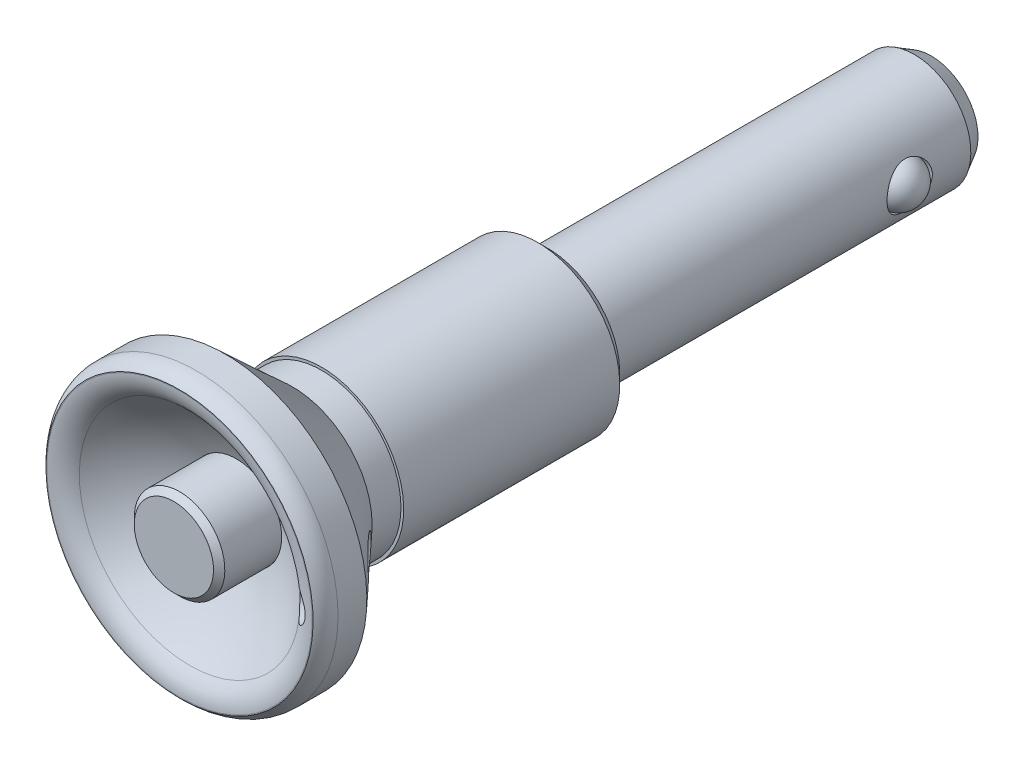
ISO-10303-21;
HEADER;
FILE_DESCRIPTION(('STEP AP214'),'2;1');
FILE_NAME('part.step','',(''),(''),'','','');
FILE_SCHEMA(('AUTOMOTIVE_DESIGN { 1 0 10303 214 1 1 1 1 }'));
ENDSEC;
DATA;
#1=APPLICATION_CONTEXT('core data for automotive mechanical design processes');
#2=APPLICATION_PROTOCOL_DEFINITION('international standard','automotive_design',2000,#1);
#3=PRODUCT_CONTEXT('',#1,'mechanical');
#4=PRODUCT('Part','Part','',(#3));
#5=PRODUCT_RELATED_PRODUCT_CATEGORY('part','',(#4));
#6=PRODUCT_DEFINITION_FORMATION('','',#4);
#7=PRODUCT_DEFINITION_CONTEXT('part definition',#1,'design');
#8=PRODUCT_DEFINITION('design','',#6,#7);
#9=PRODUCT_DEFINITION_SHAPE('','',#8);
#10=(LENGTH_UNIT() NAMED_UNIT(*) SI_UNIT(.MILLI.,.METRE.));
#11=(NAMED_UNIT(*) PLANE_ANGLE_UNIT() SI_UNIT($,.RADIAN.));
#12=(NAMED_UNIT(*) SI_UNIT($,.STERADIAN.) SOLID_ANGLE_UNIT());
#13=UNCERTAINTY_MEASURE_WITH_UNIT(LENGTH_MEASURE(1.E-05),#10,'distance_accuracy_value','');
#14=(GEOMETRIC_REPRESENTATION_CONTEXT(3) GLOBAL_UNCERTAINTY_ASSIGNED_CONTEXT((#13)) GLOBAL_UNIT_ASSIGNED_CONTEXT((#10,
#11,#12)) REPRESENTATION_CONTEXT('',''));
#15=CARTESIAN_POINT('',(0.,0.,0.));
#16=DIRECTION('',(0.,0.,1.));
#17=DIRECTION('',(1.,0.,0.));
#18=AXIS2_PLACEMENT_3D('',#15,#16,#17);
#19=CARTESIAN_POINT('',(0.,0.,-33.9));
#20=DIRECTION('',(0.,0.,-1.));
#21=DIRECTION('',(0.,1.,0.));
#22=AXIS2_PLACEMENT_3D('',#19,#20,#21);
#23=CYLINDRICAL_SURFACE('',#22,2.);
#24=CARTESIAN_POINT('',(0.,0.,-29.9));
#25=DIRECTION('',(0.,0.,-1.));
#26=DIRECTION('',(0.,1.,0.));
#27=AXIS2_PLACEMENT_3D('',#24,#25,#26);
#28=CIRCLE('',#27,2.);
#29=CARTESIAN_POINT('',(0.,2.,-29.9));
#30=VERTEX_POINT('',#29);
#31=EDGE_CURVE('E9',#30,#30,#28,.T.);
#32=ORIENTED_EDGE('',*,*,#31,.F.);
#33=EDGE_LOOP('',(#32));
#34=FACE_BOUND('',#33,.T.);
#35=CARTESIAN_POINT('',(0.,0.,-33.9));
#36=DIRECTION('',(0.,0.,-1.));
#37=DIRECTION('',(0.,1.,0.));
#38=AXIS2_PLACEMENT_3D('',#35,#36,#37);
#39=CIRCLE('',#38,2.);
#40=CARTESIAN_POINT('',(0.,2.,-33.9));
#41=VERTEX_POINT('',#40);
#42=EDGE_CURVE('E420',#41,#41,#39,.T.);
#43=ORIENTED_EDGE('',*,*,#42,.T.);
#44=EDGE_LOOP('',(#43));
#45=FACE_BOUND('',#44,.T.);
#46=ADVANCED_FACE('F14',(#34,#45),#23,.F.);
#47=CARTESIAN_POINT('',(0.,0.,-33.9));
#48=DIRECTION('',(0.,0.,-1.));
#49=DIRECTION('',(0.,1.,0.));
#50=AXIS2_PLACEMENT_3D('',#47,#48,#49);
#51=CYLINDRICAL_SURFACE('',#50,5.);
#52=CARTESIAN_POINT('',(4.58257569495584,2.,-27.));
#53=CARTESIAN_POINT('',(4.58258022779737,1.99999540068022,-27.107123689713));
#54=CARTESIAN_POINT('',(4.58638433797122,1.99134173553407,-27.2144262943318));
#55=CARTESIAN_POINT('',(4.601110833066,1.95706710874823,-27.4259390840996));
#56=CARTESIAN_POINT('',(4.61205140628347,1.93140279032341,-27.5301406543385));
#57=CARTESIAN_POINT('',(4.63960410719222,1.86423554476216,-27.7320518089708));
#58=CARTESIAN_POINT('',(4.65619484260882,1.82279228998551,-27.8297842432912));
#59=CARTESIAN_POINT('',(4.69314677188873,1.72542013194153,-28.0168853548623));
#60=CARTESIAN_POINT('',(4.71350714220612,1.66949439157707,-28.1062558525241));
#61=CARTESIAN_POINT('',(4.75700861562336,1.54132201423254,-28.2792603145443));
#62=CARTESIAN_POINT('',(4.78023917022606,1.46837936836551,-28.3623563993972));
#63=CARTESIAN_POINT('',(4.82612457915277,1.30970909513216,-28.5155290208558));
#64=CARTESIAN_POINT('',(4.84877922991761,1.22397701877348,-28.5856010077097));
#65=CARTESIAN_POINT('',(4.89203407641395,1.03800631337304,-28.7134063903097));
#66=CARTESIAN_POINT('',(4.9125180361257,0.937328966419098,-28.7705442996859));
#67=CARTESIAN_POINT('',(4.94803927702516,0.72682532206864,-28.8668435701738));
#68=CARTESIAN_POINT('',(4.96307877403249,0.617002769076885,-28.9060122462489));
#69=CARTESIAN_POINT('',(4.98538324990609,0.396966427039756,-28.9633414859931));
#70=CARTESIAN_POINT('',(4.99298936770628,0.28702898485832,-28.9824273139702));
#71=CARTESIAN_POINT('',(5.0008031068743,0.0652663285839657,-29.0020284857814));
#72=CARTESIAN_POINT('',(5.00101348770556,-0.0465581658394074,-29.0025507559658));
#73=CARTESIAN_POINT('',(4.99421962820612,-0.262232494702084,-28.9855172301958));
#74=CARTESIAN_POINT('',(4.98761996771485,-0.366177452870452,-28.9689752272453));
#75=CARTESIAN_POINT('',(4.96849291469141,-0.569673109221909,-28.920007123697));
#76=CARTESIAN_POINT('',(4.95596508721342,-0.669223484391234,-28.8875798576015));
#77=CARTESIAN_POINT('',(4.92596824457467,-0.862897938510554,-28.8073635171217));
#78=CARTESIAN_POINT('',(4.90842760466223,-0.956917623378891,-28.7593502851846));
#79=CARTESIAN_POINT('',(4.87014585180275,-1.13580815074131,-28.6495349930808));
#80=CARTESIAN_POINT('',(4.84940364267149,-1.22067584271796,-28.5877282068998));
#81=CARTESIAN_POINT('',(4.80521637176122,-1.38476882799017,-28.4473508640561));
#82=CARTESIAN_POINT('',(4.78168326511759,-1.46325784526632,-28.3679461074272));
#83=CARTESIAN_POINT('',(4.73561660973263,-1.60610741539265,-28.197009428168));
#84=CARTESIAN_POINT('',(4.71308339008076,-1.67046334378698,-28.1054735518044));
#85=CARTESIAN_POINT('',(4.67096897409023,-1.78490418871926,-27.9095809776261));
#86=CARTESIAN_POINT('',(4.65148914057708,-1.83453465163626,-27.8049351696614));
#87=CARTESIAN_POINT('',(4.61887590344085,-1.91517625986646,-27.5877845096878));
#88=CARTESIAN_POINT('',(4.60573837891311,-1.94619949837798,-27.4752848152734));
#89=CARTESIAN_POINT('',(4.58829759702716,-1.9869549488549,-27.2529642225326));
#90=CARTESIAN_POINT('',(4.58350366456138,-1.99787209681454,-27.1433995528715));
#91=CARTESIAN_POINT('',(4.58189497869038,-2.00156132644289,-26.9239227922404));
#92=CARTESIAN_POINT('',(4.58507780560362,-1.99433891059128,-26.8140108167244));
#93=CARTESIAN_POINT('',(4.59856044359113,-1.96303289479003,-26.6035410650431));
#94=CARTESIAN_POINT('',(4.60844457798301,-1.93993306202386,-26.5028070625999));
#95=CARTESIAN_POINT('',(4.6337005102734,-1.87880418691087,-26.3067115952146));
#96=CARTESIAN_POINT('',(4.64907352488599,-1.84077183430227,-26.2113513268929));
#97=CARTESIAN_POINT('',(4.68433781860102,-1.74913563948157,-26.0243976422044));
#98=CARTESIAN_POINT('',(4.70438704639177,-1.69496286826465,-25.9331138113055));
#99=CARTESIAN_POINT('',(4.74650385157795,-1.57316522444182,-25.7605170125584));
#100=CARTESIAN_POINT('',(4.76857224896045,-1.5055348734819,-25.6792081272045));
#101=CARTESIAN_POINT('',(4.81420915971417,-1.35284421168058,-25.5226265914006));
#102=CARTESIAN_POINT('',(4.83776807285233,-1.26686542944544,-25.4482434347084));
#103=CARTESIAN_POINT('',(4.88219794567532,-1.08308363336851,-25.3148229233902));
#104=CARTESIAN_POINT('',(4.90306879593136,-0.98528013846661,-25.2557861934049));
#105=CARTESIAN_POINT('',(4.9398371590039,-0.780279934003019,-25.1549523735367));
#106=CARTESIAN_POINT('',(4.9557358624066,-0.673085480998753,-25.1131511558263));
#107=CARTESIAN_POINT('',(4.98072713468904,-0.452393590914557,-25.0484511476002));
#108=CARTESIAN_POINT('',(4.98982339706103,-0.338899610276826,-25.0255420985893));
#109=CARTESIAN_POINT('',(4.99979008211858,-0.11681651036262,-25.0004952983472));
#110=CARTESIAN_POINT('',(5.00115846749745,-0.008390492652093,-24.997099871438));
#111=CARTESIAN_POINT('',(4.99686042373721,0.20743383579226,-25.0078554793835));
#112=CARTESIAN_POINT('',(4.99119505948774,0.314832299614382,-25.0220038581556));
#113=CARTESIAN_POINT('',(4.97371513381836,0.522170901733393,-25.0665467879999));
#114=CARTESIAN_POINT('',(4.96209480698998,0.622238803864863,-25.0964289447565));
#115=CARTESIAN_POINT('',(4.93394947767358,0.815922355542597,-25.1710528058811));
#116=CARTESIAN_POINT('',(4.91742357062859,0.909536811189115,-25.2157972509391));
#117=CARTESIAN_POINT('',(4.88018094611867,1.09220303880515,-25.3211031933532));
#118=CARTESIAN_POINT('',(4.859311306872,1.18087037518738,-25.3822762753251));
#119=CARTESIAN_POINT('',(4.8158940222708,1.34705404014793,-25.517788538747));
#120=CARTESIAN_POINT('',(4.79334568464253,1.42456572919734,-25.5921331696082));
#121=CARTESIAN_POINT('',(4.74737767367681,1.57120121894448,-25.7573151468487));
#122=CARTESIAN_POINT('',(4.72399047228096,1.63950871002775,-25.8488885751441));
#123=CARTESIAN_POINT('',(4.68049656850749,1.75984762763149,-26.0429424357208));
#124=CARTESIAN_POINT('',(4.66039025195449,1.81187714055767,-26.1454241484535));
#125=CARTESIAN_POINT('',(4.62758914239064,1.89399048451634,-26.3490361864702));
#126=CARTESIAN_POINT('',(4.61439096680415,1.92562535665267,-26.4494616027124));
#127=CARTESIAN_POINT('',(4.5944582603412,1.97271990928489,-26.6544890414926));
#128=CARTESIAN_POINT('',(4.58770572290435,1.98822466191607,-26.7590785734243));
#129=CARTESIAN_POINT('',(4.5839176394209,1.99692202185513,-26.8867782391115));
#130=CARTESIAN_POINT('',(4.58341531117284,1.99807530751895,-26.9094014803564));
#131=CARTESIAN_POINT('',(4.58274384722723,1.9996148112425,-26.9546804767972));
#132=CARTESIAN_POINT('',(4.5825747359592,2.0000009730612,-26.9773362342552));
#133=CARTESIAN_POINT('',(4.58257569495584,2.,-27.));
#134=B_SPLINE_CURVE_WITH_KNOTS('',3,(#52,#53,#54,#55,#56,#57,#58,#59,#60,#61,#62,#63,#64,#65,
#66,#67,#68,#69,#70,#71,#72,#73,#74,#75,#76,#77,#78,#79,#80,#81,#82,#83,#84,#85,#86,#87,#88,#89,
#90,#91,#92,#93,#94,#95,#96,#97,#98,#99,#100,#101,#102,#103,#104,#105,#106,#107,#108,#109,#110,
#111,#112,#113,#114,#115,#116,#117,#118,#119,#120,#121,#122,#123,#124,#125,#126,#127,#128,#129,
#130,#131,#132,#133),.UNSPECIFIED.,.T.,.F.,(4,2,2,2,2,2,2,2,2,2,2,2,2,2,2,2,2,2,2,2,2,2,2,2,2,2,
2,2,2,2,2,2,2,2,2,2,2,2,2,2,4),(0.,0.321277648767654,0.643377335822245,0.964270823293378,
1.2850942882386,1.62255618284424,1.96013574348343,2.31102669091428,2.6617746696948,
2.99554182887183,3.32918445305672,3.64408644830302,3.95901155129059,4.27868300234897,
4.5984641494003,4.93924044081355,5.28012807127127,5.63064458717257,5.980933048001,
6.30982147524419,6.63861014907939,6.94867248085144,7.25880358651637,7.58151154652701,
7.9043511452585,8.25103734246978,8.59773764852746,8.94435487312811,9.29078375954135,
9.61461039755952,9.938388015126,10.2522199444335,10.5661097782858,10.8938705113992,
11.2217671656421,11.5699625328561,11.9181988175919,12.2351666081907,12.5512463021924,
12.619212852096,12.6871843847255),.UNSPECIFIED.);
#135=CARTESIAN_POINT('',(4.58257569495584,2.,-27.));
#136=VERTEX_POINT('',#135);
#137=EDGE_CURVE('E401',#136,#136,#134,.T.);
#138=ORIENTED_EDGE('',*,*,#137,.T.);
#139=EDGE_LOOP('',(#138));
#140=FACE_BOUND('',#139,.T.);
#141=CARTESIAN_POINT('',(0.,0.,-32.4));
#142=DIRECTION('',(0.,0.,-1.));
#143=DIRECTION('',(0.,1.,0.));
#144=AXIS2_PLACEMENT_3D('',#141,#142,#143);
#145=CIRCLE('',#144,5.);
#146=CARTESIAN_POINT('',(0.,5.,-32.4));
#147=VERTEX_POINT('',#146);
#148=EDGE_CURVE('E67',#147,#147,#145,.T.);
#149=ORIENTED_EDGE('',*,*,#148,.F.);
#150=EDGE_LOOP('',(#149));
#151=FACE_BOUND('',#150,.T.);
#152=CARTESIAN_POINT('',(-4.58257569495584,2.,-27.));
#153=CARTESIAN_POINT('',(-4.58258022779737,1.99999540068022,-26.892876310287));
#154=CARTESIAN_POINT('',(-4.58638433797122,1.99134173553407,-26.7855737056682));
#155=CARTESIAN_POINT('',(-4.601110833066,1.95706710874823,-26.5740609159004));
#156=CARTESIAN_POINT('',(-4.61205140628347,1.93140279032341,-26.4698593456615));
#157=CARTESIAN_POINT('',(-4.63960410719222,1.86423554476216,-26.2679481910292));
#158=CARTESIAN_POINT('',(-4.65619484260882,1.82279228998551,-26.1702157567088));
#159=CARTESIAN_POINT('',(-4.69314677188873,1.72542013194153,-25.9831146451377));
#160=CARTESIAN_POINT('',(-4.71350714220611,1.66949439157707,-25.8937441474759));
#161=CARTESIAN_POINT('',(-4.75700861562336,1.54132201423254,-25.7207396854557));
#162=CARTESIAN_POINT('',(-4.78023917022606,1.46837936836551,-25.6376436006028));
#163=CARTESIAN_POINT('',(-4.82612457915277,1.30970909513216,-25.4844709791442));
#164=CARTESIAN_POINT('',(-4.84877922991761,1.22397701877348,-25.4143989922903));
#165=CARTESIAN_POINT('',(-4.89203407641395,1.03800631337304,-25.2865936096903));
#166=CARTESIAN_POINT('',(-4.9125180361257,0.937328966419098,-25.2294557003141));
#167=CARTESIAN_POINT('',(-4.94803927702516,0.726825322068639,-25.1331564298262));
#168=CARTESIAN_POINT('',(-4.96307877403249,0.617002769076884,-25.0939877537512));
#169=CARTESIAN_POINT('',(-4.98538324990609,0.396966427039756,-25.0366585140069));
#170=CARTESIAN_POINT('',(-4.99298936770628,0.28702898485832,-25.0175726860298));
#171=CARTESIAN_POINT('',(-5.0008031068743,0.0652663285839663,-24.9979715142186));
#172=CARTESIAN_POINT('',(-5.00101348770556,-0.0465581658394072,-24.9974492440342));
#173=CARTESIAN_POINT('',(-4.99421962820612,-0.262232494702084,-25.0144827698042));
#174=CARTESIAN_POINT('',(-4.98761996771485,-0.366177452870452,-25.0310247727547));
#175=CARTESIAN_POINT('',(-4.96849291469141,-0.569673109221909,-25.079992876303));
#176=CARTESIAN_POINT('',(-4.95596508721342,-0.669223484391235,-25.1124201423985));
#177=CARTESIAN_POINT('',(-4.92596824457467,-0.862897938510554,-25.1926364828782));
#178=CARTESIAN_POINT('',(-4.90842760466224,-0.95691762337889,-25.2406497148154));
#179=CARTESIAN_POINT('',(-4.87014585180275,-1.13580815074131,-25.3504650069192));
#180=CARTESIAN_POINT('',(-4.84940364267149,-1.22067584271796,-25.4122717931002));
#181=CARTESIAN_POINT('',(-4.80521637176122,-1.38476882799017,-25.5526491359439));
#182=CARTESIAN_POINT('',(-4.78168326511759,-1.46325784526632,-25.6320538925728));
#183=CARTESIAN_POINT('',(-4.73561660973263,-1.60610741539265,-25.802990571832));
#184=CARTESIAN_POINT('',(-4.71308339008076,-1.67046334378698,-25.8945264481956));
#185=CARTESIAN_POINT('',(-4.67096897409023,-1.78490418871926,-26.0904190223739));
#186=CARTESIAN_POINT('',(-4.65148914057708,-1.83453465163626,-26.1950648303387));
#187=CARTESIAN_POINT('',(-4.61887590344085,-1.91517625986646,-26.4122154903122));
#188=CARTESIAN_POINT('',(-4.60573837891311,-1.94619949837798,-26.5247151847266));
#189=CARTESIAN_POINT('',(-4.58829759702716,-1.9869549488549,-26.7470357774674));
#190=CARTESIAN_POINT('',(-4.58350366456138,-1.99787209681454,-26.8566004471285));
#191=CARTESIAN_POINT('',(-4.58189497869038,-2.00156132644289,-27.0760772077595));
#192=CARTESIAN_POINT('',(-4.58507780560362,-1.99433891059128,-27.1859891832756));
#193=CARTESIAN_POINT('',(-4.59856044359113,-1.96303289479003,-27.3964589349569));
#194=CARTESIAN_POINT('',(-4.60844457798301,-1.93993306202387,-27.4971929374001));
#195=CARTESIAN_POINT('',(-4.6337005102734,-1.87880418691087,-27.6932884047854));
#196=CARTESIAN_POINT('',(-4.64907352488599,-1.84077183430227,-27.7886486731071));
#197=CARTESIAN_POINT('',(-4.68433781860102,-1.74913563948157,-27.9756023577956));
#198=CARTESIAN_POINT('',(-4.70438704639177,-1.69496286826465,-28.0668861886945));
#199=CARTESIAN_POINT('',(-4.74650385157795,-1.57316522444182,-28.2394829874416));
#200=CARTESIAN_POINT('',(-4.76857224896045,-1.5055348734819,-28.3207918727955));
#201=CARTESIAN_POINT('',(-4.81420915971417,-1.35284421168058,-28.4773734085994));
#202=CARTESIAN_POINT('',(-4.83776807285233,-1.26686542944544,-28.5517565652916));
#203=CARTESIAN_POINT('',(-4.88219794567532,-1.08308363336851,-28.6851770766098));
#204=CARTESIAN_POINT('',(-4.90306879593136,-0.98528013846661,-28.7442138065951));
#205=CARTESIAN_POINT('',(-4.9398371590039,-0.780279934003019,-28.8450476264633));
#206=CARTESIAN_POINT('',(-4.9557358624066,-0.673085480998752,-28.8868488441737));
#207=CARTESIAN_POINT('',(-4.98072713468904,-0.452393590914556,-28.9515488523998));
#208=CARTESIAN_POINT('',(-4.98982339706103,-0.338899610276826,-28.9744579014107));
#209=CARTESIAN_POINT('',(-4.99979008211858,-0.11681651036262,-28.9995047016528));
#210=CARTESIAN_POINT('',(-5.00115846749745,-0.00839049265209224,-29.002900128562));
#211=CARTESIAN_POINT('',(-4.99686042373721,0.207433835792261,-28.9921445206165));
#212=CARTESIAN_POINT('',(-4.99119505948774,0.314832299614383,-28.9779961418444));
#213=CARTESIAN_POINT('',(-4.97371513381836,0.522170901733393,-28.9334532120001));
#214=CARTESIAN_POINT('',(-4.96209480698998,0.622238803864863,-28.9035710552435));
#215=CARTESIAN_POINT('',(-4.93394947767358,0.815922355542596,-28.8289471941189));
#216=CARTESIAN_POINT('',(-4.91742357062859,0.909536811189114,-28.7842027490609));
#217=CARTESIAN_POINT('',(-4.88018094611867,1.09220303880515,-28.6788968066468));
#218=CARTESIAN_POINT('',(-4.859311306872,1.18087037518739,-28.6177237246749));
#219=CARTESIAN_POINT('',(-4.8158940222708,1.34705404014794,-28.482211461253));
#220=CARTESIAN_POINT('',(-4.79334568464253,1.42456572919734,-28.4078668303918));
#221=CARTESIAN_POINT('',(-4.74737767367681,1.57120121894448,-28.2426848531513));
#222=CARTESIAN_POINT('',(-4.72399047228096,1.63950871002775,-28.1511114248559));
#223=CARTESIAN_POINT('',(-4.68049656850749,1.75984762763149,-27.9570575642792));
#224=CARTESIAN_POINT('',(-4.66039025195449,1.81187714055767,-27.8545758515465));
#225=CARTESIAN_POINT('',(-4.62758914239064,1.89399048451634,-27.6509638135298));
#226=CARTESIAN_POINT('',(-4.61439096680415,1.92562535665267,-27.5505383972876));
#227=CARTESIAN_POINT('',(-4.5944582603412,1.97271990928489,-27.3455109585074));
#228=CARTESIAN_POINT('',(-4.58770572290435,1.98822466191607,-27.2409214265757));
#229=CARTESIAN_POINT('',(-4.5839176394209,1.99692202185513,-27.1132217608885));
#230=CARTESIAN_POINT('',(-4.58341531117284,1.99807530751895,-27.0905985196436));
#231=CARTESIAN_POINT('',(-4.58274384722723,1.9996148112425,-27.0453195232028));
#232=CARTESIAN_POINT('',(-4.5825747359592,2.0000009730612,-27.0226637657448));
#233=CARTESIAN_POINT('',(-4.58257569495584,2.,-27.));
#234=B_SPLINE_CURVE_WITH_KNOTS('',3,(#152,#153,#154,#155,#156,#157,#158,#159,#160,#161,#162,
#163,#164,#165,#166,#167,#168,#169,#170,#171,#172,#173,#174,#175,#176,#177,#178,#179,#180,#181,
#182,#183,#184,#185,#186,#187,#188,#189,#190,#191,#192,#193,#194,#195,#196,#197,#198,#199,#200,
#201,#202,#203,#204,#205,#206,#207,#208,#209,#210,#211,#212,#213,#214,#215,#216,#217,#218,#219,
#220,#221,#222,#223,#224,#225,#226,#227,#228,#229,#230,#231,#232,#233),.UNSPECIFIED.,.T.,.F.,(4,
2,2,2,2,2,2,2,2,2,2,2,2,2,2,2,2,2,2,2,2,2,2,2,2,2,2,2,2,2,2,2,2,2,2,2,2,2,2,2,4),(0.,
0.321277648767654,0.643377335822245,0.964270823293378,1.2850942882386,1.62255618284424,
1.96013574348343,2.31102669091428,2.6617746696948,2.99554182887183,3.32918445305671,
3.64408644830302,3.95901155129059,4.27868300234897,4.5984641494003,4.93924044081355,
5.28012807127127,5.63064458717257,5.98093304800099,6.30982147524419,6.63861014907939,
6.94867248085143,7.25880358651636,7.581511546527,7.9043511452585,8.25103734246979,
8.59773764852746,8.94435487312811,9.29078375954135,9.61461039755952,9.938388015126,
10.2522199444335,10.5661097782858,10.8938705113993,11.2217671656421,11.5699625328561,
11.9181988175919,12.2351666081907,12.5512463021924,12.619212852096,12.6871843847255),.UNSPECIFIED.);
#235=CARTESIAN_POINT('',(-4.58257569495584,2.,-27.));
#236=VERTEX_POINT('',#235);
#237=EDGE_CURVE('E61',#236,#236,#234,.T.);
#238=ORIENTED_EDGE('',*,*,#237,.T.);
#239=EDGE_LOOP('',(#238));
#240=FACE_BOUND('',#239,.T.);
#241=CARTESIAN_POINT('',(0.,0.,0.));
#242=DIRECTION('',(0.,0.,1.));
#243=DIRECTION('',(1.,0.,0.));
#244=AXIS2_PLACEMENT_3D('',#241,#242,#243);
#245=CIRCLE('',#244,5.);
#246=CARTESIAN_POINT('',(5.,0.,0.));
#247=VERTEX_POINT('',#246);
#248=EDGE_CURVE('E73',#247,#247,#245,.T.);
#249=ORIENTED_EDGE('',*,*,#248,.F.);
#250=EDGE_LOOP('',(#249));
#251=FACE_BOUND('',#250,.T.);
#252=ADVANCED_FACE('F395',(#140,#151,#240,#251),#51,.T.);
#253=CARTESIAN_POINT('',(2.,0.,-33.9));
#254=DIRECTION('',(0.,0.,-1.));
#255=DIRECTION('',(0.,1.,0.));
#256=AXIS2_PLACEMENT_3D('',#253,#254,#255);
#257=PLANE('',#256);
#258=CARTESIAN_POINT('',(0.,0.,-33.9));
#259=DIRECTION('',(0.,0.,-1.));
#260=DIRECTION('',(0.,1.,0.));
#261=AXIS2_PLACEMENT_3D('',#258,#259,#260);
#262=CIRCLE('',#261,4.13397459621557);
#263=CARTESIAN_POINT('',(0.,4.13397459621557,-33.9));
#264=VERTEX_POINT('',#263);
#265=EDGE_CURVE('E424',#264,#264,#262,.T.);
#266=ORIENTED_EDGE('',*,*,#265,.T.);
#267=EDGE_LOOP('',(#266));
#268=FACE_BOUND('',#267,.T.);
#269=ORIENTED_EDGE('',*,*,#42,.F.);
#270=EDGE_LOOP('',(#269));
#271=FACE_BOUND('',#270,.T.);
#272=ADVANCED_FACE('F437',(#268,#271),#257,.T.);
#273=CARTESIAN_POINT('',(0.,0.,-33.9));
#274=DIRECTION('',(0.,0.,1.));
#275=DIRECTION('',(0.,-1.,0.));
#276=AXIS2_PLACEMENT_3D('',#273,#274,#275);
#277=CONICAL_SURFACE('',#276,4.13397459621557,0.523598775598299);
#278=ORIENTED_EDGE('',*,*,#148,.T.);
#279=EDGE_LOOP('',(#278));
#280=FACE_BOUND('',#279,.T.);
#281=ORIENTED_EDGE('',*,*,#265,.F.);
#282=EDGE_LOOP('',(#281));
#283=FACE_BOUND('',#282,.T.);
#284=ADVANCED_FACE('F433',(#280,#283),#277,.T.);
#285=CARTESIAN_POINT('',(6.,0.,-27.));
#286=DIRECTION('',(1.,0.,0.));
#287=DIRECTION('',(0.,1.,0.));
#288=AXIS2_PLACEMENT_3D('',#285,#286,#287);
#289=CYLINDRICAL_SURFACE('',#288,2.);
#290=CARTESIAN_POINT('',(3.69295257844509,2.,-27.));
#291=CARTESIAN_POINT('',(3.69296124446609,1.99999252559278,-26.8950365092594));
#292=CARTESIAN_POINT('',(3.69749476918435,1.99168229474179,-26.7899198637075));
#293=CARTESIAN_POINT('',(3.71499510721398,1.95883523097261,-26.5828549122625));
#294=CARTESIAN_POINT('',(3.7279812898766,1.93426112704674,-26.4809144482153));
#295=CARTESIAN_POINT('',(3.76054820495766,1.87014699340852,-26.2835779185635));
#296=CARTESIAN_POINT('',(3.78009636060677,1.83068077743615,-26.1881522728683));
#297=CARTESIAN_POINT('',(3.82353505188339,1.73812635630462,-26.0052997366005));
#298=CARTESIAN_POINT('',(3.84742546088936,1.68503854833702,-25.9178726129));
#299=CARTESIAN_POINT('',(3.89903612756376,1.56210627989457,-25.7462961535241));
#300=CARTESIAN_POINT('',(3.92690909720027,1.49130855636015,-25.6628754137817));
#301=CARTESIAN_POINT('',(3.98210623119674,1.33695443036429,-25.5085333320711));
#302=CARTESIAN_POINT('',(4.00943013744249,1.25339217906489,-25.437617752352));
#303=CARTESIAN_POINT('',(4.0624063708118,1.06976932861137,-25.3061632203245));
#304=CARTESIAN_POINT('',(4.08786122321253,0.969021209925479,-25.2464976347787));
#305=CARTESIAN_POINT('',(4.1322840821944,0.757479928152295,-25.1452903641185));
#306=CARTESIAN_POINT('',(4.15125580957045,0.646692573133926,-25.1037382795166));
#307=CARTESIAN_POINT('',(4.17948005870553,0.425917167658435,-25.0427479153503));
#308=CARTESIAN_POINT('',(4.18928822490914,0.316352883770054,-25.0220384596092));
#309=CARTESIAN_POINT('',(4.20013773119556,0.0948978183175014,-24.9991585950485));
#310=CARTESIAN_POINT('',(4.20118382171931,-0.016991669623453,-24.996978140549));
#311=CARTESIAN_POINT('',(4.1946744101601,-0.230460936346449,-25.0106738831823));
#312=CARTESIAN_POINT('',(4.18779244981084,-0.332156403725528,-25.0251360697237));
#313=CARTESIAN_POINT('',(4.1671904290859,-0.531473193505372,-25.0692085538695));
#314=CARTESIAN_POINT('',(4.15346986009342,-0.629094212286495,-25.0988199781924));
#315=CARTESIAN_POINT('',(4.12021451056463,-0.819264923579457,-25.1726068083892));
#316=CARTESIAN_POINT('',(4.10059733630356,-0.911719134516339,-25.2169896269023));
#317=CARTESIAN_POINT('',(4.05736238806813,-1.08810289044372,-25.3188060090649));
#318=CARTESIAN_POINT('',(4.03374315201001,-1.17202930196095,-25.376244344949));
#319=CARTESIAN_POINT('',(3.98232079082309,-1.33682830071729,-25.508356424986));
#320=CARTESIAN_POINT('',(3.95433239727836,-1.41678585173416,-25.5841006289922));
#321=CARTESIAN_POINT('',(3.89872441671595,-1.56333053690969,-25.7477715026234));
#322=CARTESIAN_POINT('',(3.87110507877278,-1.62990902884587,-25.8357059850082));
#323=CARTESIAN_POINT('',(3.81780436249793,-1.75125633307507,-26.0270633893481));
#324=CARTESIAN_POINT('',(3.79230552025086,-1.80520353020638,-26.1310630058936));
#325=CARTESIAN_POINT('',(3.74853610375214,-1.89443193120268,-26.3481814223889));
#326=CARTESIAN_POINT('',(3.73025862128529,-1.92973098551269,-26.4612913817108));
#327=CARTESIAN_POINT('',(3.70489726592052,-1.97796079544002,-26.6842923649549));
#328=CARTESIAN_POINT('',(3.69706613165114,-1.99239193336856,-26.7937711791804));
#329=CARTESIAN_POINT('',(3.69134421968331,-2.00297881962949,-27.013842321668));
#330=CARTESIAN_POINT('',(3.69344777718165,-1.99914498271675,-27.1244339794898));
#331=CARTESIAN_POINT('',(3.70656984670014,-1.97468704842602,-27.3324720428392));
#332=CARTESIAN_POINT('',(3.71672580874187,-1.95568631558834,-27.4301719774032));
#333=CARTESIAN_POINT('',(3.74358473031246,-1.90376463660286,-27.6208457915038));
#334=CARTESIAN_POINT('',(3.76028958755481,-1.8708396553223,-27.7138182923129));
#335=CARTESIAN_POINT('',(3.79928393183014,-1.79036865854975,-27.8972604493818));
#336=CARTESIAN_POINT('',(3.82179608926,-1.74221652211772,-27.9874151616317));
#337=CARTESIAN_POINT('',(3.86963561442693,-1.63320542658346,-28.1588668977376));
#338=CARTESIAN_POINT('',(3.89496439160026,-1.5723400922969,-28.2401594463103));
#339=CARTESIAN_POINT('',(3.94900124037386,-1.43163394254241,-28.401103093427));
#340=CARTESIAN_POINT('',(3.97776977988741,-1.35043069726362,-28.4795481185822));
#341=CARTESIAN_POINT('',(4.03293385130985,-1.17547949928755,-28.6220285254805));
#342=CARTESIAN_POINT('',(4.05932880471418,-1.08172850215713,-28.6860604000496));
#343=CARTESIAN_POINT('',(4.10741012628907,-0.881934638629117,-28.7987682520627));
#344=CARTESIAN_POINT('',(4.12900486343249,-0.775703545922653,-28.8471523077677));
#345=CARTESIAN_POINT('',(4.16436909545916,-0.555289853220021,-28.9249103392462));
#346=CARTESIAN_POINT('',(4.17814481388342,-0.441113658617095,-28.9542994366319));
#347=CARTESIAN_POINT('',(4.19540926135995,-0.218647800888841,-28.9909275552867));
#348=CARTESIAN_POINT('',(4.19968035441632,-0.110695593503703,-28.9998531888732));
#349=CARTESIAN_POINT('',(4.1998175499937,0.105223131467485,-29.0001430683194));
#350=CARTESIAN_POINT('',(4.19568607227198,0.213189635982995,-28.9915123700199));
#351=CARTESIAN_POINT('',(4.17993566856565,0.419731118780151,-28.9581010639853));
#352=CARTESIAN_POINT('',(4.168749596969,0.518493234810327,-28.9342532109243));
#353=CARTESIAN_POINT('',(4.1403533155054,0.710491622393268,-28.872267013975));
#354=CARTESIAN_POINT('',(4.12314216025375,0.80372702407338,-28.8341264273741));
#355=CARTESIAN_POINT('',(4.08331986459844,0.98669006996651,-28.7428034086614));
#356=CARTESIAN_POINT('',(4.06050114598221,1.07607281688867,-28.6890230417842));
#357=CARTESIAN_POINT('',(4.01195381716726,1.24493254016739,-28.5687268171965));
#358=CARTESIAN_POINT('',(3.98622388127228,1.32440496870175,-28.5022051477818));
#359=CARTESIAN_POINT('',(3.9317186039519,1.47877758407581,-28.3512584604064));
#360=CARTESIAN_POINT('',(3.90287905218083,1.55260530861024,-28.2657556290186));
#361=CARTESIAN_POINT('',(3.8474945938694,1.68518766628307,-28.0830092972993));
#362=CARTESIAN_POINT('',(3.82095142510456,1.74393094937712,-27.9857570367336));
#363=CARTESIAN_POINT('',(3.77299479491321,1.84543916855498,-27.7795828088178));
#364=CARTESIAN_POINT('',(3.75168341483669,1.88789405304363,-27.6704807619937));
#365=CARTESIAN_POINT('',(3.72647961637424,1.93689798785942,-27.5018569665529));
#366=CARTESIAN_POINT('',(3.71920915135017,1.95078018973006,-27.4448752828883));
#367=CARTESIAN_POINT('',(3.70719734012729,1.97351358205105,-27.3296687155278));
#368=CARTESIAN_POINT('',(3.7024541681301,1.98236840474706,-27.2714447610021));
#369=CARTESIAN_POINT('',(3.69705078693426,1.99241849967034,-27.1775698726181));
#370=CARTESIAN_POINT('',(3.69551719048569,1.99525904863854,-27.1421353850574));
#371=CARTESIAN_POINT('',(3.69346659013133,1.99905111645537,-27.0711398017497));
#372=CARTESIAN_POINT('',(3.69294964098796,2.00000253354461,-27.035578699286));
#373=CARTESIAN_POINT('',(3.69295257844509,2.,-27.));
#374=B_SPLINE_CURVE_WITH_KNOTS('',3,(#290,#291,#292,#293,#294,#295,#296,#297,#298,#299,#300,
#301,#302,#303,#304,#305,#306,#307,#308,#309,#310,#311,#312,#313,#314,#315,#316,#317,#318,#319,
#320,#321,#322,#323,#324,#325,#326,#327,#328,#329,#330,#331,#332,#333,#334,#335,#336,#337,#338,
#339,#340,#341,#342,#343,#344,#345,#346,#347,#348,#349,#350,#351,#352,#353,#354,#355,#356,#357,
#358,#359,#360,#361,#362,#363,#364,#365,#366,#367,#368,#369,#370,#371,#372,#373),.UNSPECIFIED.,
.T.,.F.,(4,2,2,2,2,2,2,2,2,2,2,2,2,2,2,2,2,2,2,2,2,2,2,2,2,2,2,2,2,2,2,2,2,2,2,2,2,2,2,2,2,4),
(0.,0.314747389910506,0.630218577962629,0.94414622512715,1.25806471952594,1.59535393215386,
1.93279816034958,2.2904080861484,2.64781242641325,2.98178553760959,3.31557757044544,
3.62297848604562,3.9304022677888,4.24233891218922,4.55438976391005,4.89383754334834,
5.2335038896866,5.59132862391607,5.94881021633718,6.27903319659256,6.60906790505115,
6.90786821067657,7.20675516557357,7.51947407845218,7.83235018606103,8.18030775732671,
8.52834990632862,8.88255362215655,9.2364750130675,9.55997846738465,9.88338877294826,
10.1886636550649,10.4939864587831,10.8130037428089,11.1321668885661,11.4803449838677,
11.8287842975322,12.1835611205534,12.3606240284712,12.5375588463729,12.6442406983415,
12.750928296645),.UNSPECIFIED.);
#375=CARTESIAN_POINT('',(3.85225966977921,1.67272059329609,-28.0963602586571));
#376=VERTEX_POINT('',#375);
#377=CARTESIAN_POINT('',(3.85225966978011,-1.67272059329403,-28.0963602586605));
#378=VERTEX_POINT('',#377);
#379=EDGE_CURVE('E63',#376,#378,#374,.T.);
#380=ORIENTED_EDGE('',*,*,#379,.F.);
#381=CARTESIAN_POINT('',(4.19974984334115,0.,-28.9999999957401));
#382=CARTESIAN_POINT('',(4.19974979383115,0.112133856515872,-28.9999951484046));
#383=CARTESIAN_POINT('',(4.19927754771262,0.224413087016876,-28.9905315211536));
#384=CARTESIAN_POINT('',(4.19737987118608,0.445943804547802,-28.9528961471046));
#385=CARTESIAN_POINT('',(4.19595246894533,0.555188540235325,-28.9246857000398));
#386=CARTESIAN_POINT('',(4.19212216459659,0.767313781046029,-28.8503623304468));
#387=CARTESIAN_POINT('',(4.18972003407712,0.870199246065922,-28.8042635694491));
#388=CARTESIAN_POINT('',(4.18389859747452,1.06670436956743,-28.6955084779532));
#389=CARTESIAN_POINT('',(4.18047981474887,1.16032876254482,-28.6328606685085));
#390=CARTESIAN_POINT('',(4.17254294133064,1.33575977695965,-28.492765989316));
#391=CARTESIAN_POINT('',(4.16802447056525,1.41756229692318,-28.4153140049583));
#392=CARTESIAN_POINT('',(4.15774347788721,1.56703120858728,-28.2478047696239));
#393=CARTESIAN_POINT('',(4.15198042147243,1.63469150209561,-28.1577421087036));
#394=CARTESIAN_POINT('',(4.13889872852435,1.75400147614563,-27.9675249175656));
#395=CARTESIAN_POINT('',(4.1315781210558,1.80563066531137,-27.8673576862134));
#396=CARTESIAN_POINT('',(4.11478827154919,1.89126247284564,-27.6600522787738));
#397=CARTESIAN_POINT('',(4.10532235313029,1.92529209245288,-27.552925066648));
#398=CARTESIAN_POINT('',(4.08797788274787,1.96230917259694,-27.3903489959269));
#399=CARTESIAN_POINT('',(4.08173176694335,1.97228597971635,-27.3362647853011));
#400=CARTESIAN_POINT('',(4.06714094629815,1.98774141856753,-27.2278123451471));
#401=CARTESIAN_POINT('',(4.05879592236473,1.99321936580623,-27.1734440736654));
#402=CARTESIAN_POINT('',(4.04230132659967,1.99805364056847,-27.0921402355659));
#403=CARTESIAN_POINT('',(4.0361535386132,1.99910232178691,-27.0651242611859));
#404=CARTESIAN_POINT('',(4.02444072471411,1.99970372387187,-27.0347632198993));
#405=CARTESIAN_POINT('',(4.02250757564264,1.99977855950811,-27.030121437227));
#406=CARTESIAN_POINT('',(4.01814107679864,1.99989236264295,-27.0211873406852));
#407=CARTESIAN_POINT('',(4.01572346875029,1.99993228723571,-27.0168888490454));
#408=CARTESIAN_POINT('',(4.01208715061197,1.99996240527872,-27.0122892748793));
#409=CARTESIAN_POINT('',(4.01145667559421,1.99996683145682,-27.011541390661));
#410=CARTESIAN_POINT('',(4.01012709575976,1.99997459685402,-27.0101050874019));
#411=CARTESIAN_POINT('',(4.0094278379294,1.99997793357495,-27.0094168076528));
#412=CARTESIAN_POINT('',(4.0079377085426,1.99998361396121,-27.0081222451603));
#413=CARTESIAN_POINT('',(4.0071456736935,1.99998594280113,-27.0075172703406));
#414=CARTESIAN_POINT('',(4.00546606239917,1.99998963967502,-27.0064591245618));
#415=CARTESIAN_POINT('',(4.00457899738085,1.99999101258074,-27.0060051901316));
#416=CARTESIAN_POINT('',(4.00309539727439,1.99999254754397,-27.0054637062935));
#417=CARTESIAN_POINT('',(4.00252608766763,1.99999297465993,-27.005302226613));
#418=CARTESIAN_POINT('',(4.00136845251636,1.99999355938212,-27.0050769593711));
#419=CARTESIAN_POINT('',(4.00078014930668,1.99999371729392,-27.0050130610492));
#420=CARTESIAN_POINT('',(3.99960008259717,1.99999377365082,-27.0049905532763));
#421=CARTESIAN_POINT('',(3.99900831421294,1.99999367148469,-27.0050321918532));
#422=CARTESIAN_POINT('',(3.99784054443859,1.99999320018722,-27.0052160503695));
#423=CARTESIAN_POINT('',(3.99726456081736,1.99999283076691,-27.0053583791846));
#424=CARTESIAN_POINT('',(3.99596613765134,1.99999164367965,-27.0057864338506));
#425=CARTESIAN_POINT('',(3.99525401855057,1.99999072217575,-27.0061030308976));
#426=CARTESIAN_POINT('',(3.99388863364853,1.99998832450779,-27.0068440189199));
#427=CARTESIAN_POINT('',(3.99323551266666,1.99998684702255,-27.0072686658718));
#428=CARTESIAN_POINT('',(3.99148747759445,1.9999818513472,-27.008559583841));
#429=CARTESIAN_POINT('',(3.99045448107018,1.99997764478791,-27.0095084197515));
#430=CARTESIAN_POINT('',(3.98852680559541,1.99996699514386,-27.011536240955));
#431=CARTESIAN_POINT('',(3.98763259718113,1.99996054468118,-27.0126156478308));
#432=CARTESIAN_POINT('',(3.98395592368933,1.99992720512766,-27.0174572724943));
#433=CARTESIAN_POINT('',(3.98166081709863,1.99988785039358,-27.0215770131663));
#434=CARTESIAN_POINT('',(3.97753827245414,1.99977908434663,-27.030041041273));
#435=CARTESIAN_POINT('',(3.97571429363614,1.99970946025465,-27.0343867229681));
#436=CARTESIAN_POINT('',(3.96598133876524,1.99922202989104,-27.0594419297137));
#437=CARTESIAN_POINT('',(3.96058685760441,1.99847042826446,-27.081080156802));
#438=CARTESIAN_POINT('',(3.95094475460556,1.9962386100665,-27.1245892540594));
#439=CARTESIAN_POINT('',(3.94670543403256,1.99475332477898,-27.1464606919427));
#440=CARTESIAN_POINT('',(3.93509414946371,1.98918869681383,-27.2122537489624));
#441=CARTESIAN_POINT('',(3.92883855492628,1.98400126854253,-27.2563147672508));
#442=CARTESIAN_POINT('',(3.91750349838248,1.97070199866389,-27.3439535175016));
#443=CARTESIAN_POINT('',(3.9124205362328,1.96259904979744,-27.3875323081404));
#444=CARTESIAN_POINT('',(3.89827773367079,1.93388686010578,-27.5176547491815));
#445=CARTESIAN_POINT('',(3.89034994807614,1.90888988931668,-27.603398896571));
#446=CARTESIAN_POINT('',(3.87421219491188,1.83976683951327,-27.7923428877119));
#447=CARTESIAN_POINT('',(3.86644907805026,1.79238269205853,-27.8943953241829));
#448=CARTESIAN_POINT('',(3.8525798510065,1.68112524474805,-28.0892232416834));
#449=CARTESIAN_POINT('',(3.84647416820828,1.61724770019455,-28.1819963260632));
#450=CARTESIAN_POINT('',(3.83555894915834,1.4747938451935,-28.3555771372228));
#451=CARTESIAN_POINT('',(3.83074952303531,1.39621628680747,-28.4363838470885));
#452=CARTESIAN_POINT('',(3.82225891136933,1.22659246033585,-28.5836946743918));
#453=CARTESIAN_POINT('',(3.81857766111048,1.13554690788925,-28.6501996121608));
#454=CARTESIAN_POINT('',(3.8122496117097,0.943553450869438,-28.7670129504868));
#455=CARTESIAN_POINT('',(3.80960291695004,0.842604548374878,-28.8173197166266));
#456=CARTESIAN_POINT('',(3.80529420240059,0.63367717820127,-28.9002859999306));
#457=CARTESIAN_POINT('',(3.80363219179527,0.525698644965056,-28.9329453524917));
#458=CARTESIAN_POINT('',(3.80126727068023,0.30585183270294,-28.9796655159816));
#459=CARTESIAN_POINT('',(3.80056375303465,0.193986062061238,-28.9937381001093));
#460=CARTESIAN_POINT('',(3.80010387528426,-0.0305226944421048,-29.0029204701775));
#461=CARTESIAN_POINT('',(3.80034751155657,-0.143165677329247,-28.9980303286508));
#462=CARTESIAN_POINT('',(3.80178509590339,-0.365999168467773,-28.9694312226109));
#463=CARTESIAN_POINT('',(3.80297878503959,-0.476190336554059,-28.945727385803));
#464=CARTESIAN_POINT('',(3.80633396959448,-0.691023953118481,-28.8801856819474));
#465=CARTESIAN_POINT('',(3.8084954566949,-0.795666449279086,-28.8383479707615));
#466=CARTESIAN_POINT('',(3.81382337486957,-0.996448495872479,-28.7377286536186));
#467=CARTESIAN_POINT('',(3.81698992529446,-1.09258703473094,-28.6789450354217));
#468=CARTESIAN_POINT('',(3.82439824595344,-1.27362959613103,-28.5461160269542));
#469=CARTESIAN_POINT('',(3.82864008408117,-1.35853290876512,-28.4720696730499));
#470=CARTESIAN_POINT('',(3.83832255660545,-1.51475132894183,-28.3107773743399));
#471=CARTESIAN_POINT('',(3.84376398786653,-1.58605734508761,-28.2235226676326));
#472=CARTESIAN_POINT('',(3.85610678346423,-1.71297777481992,-28.0384161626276));
#473=CARTESIAN_POINT('',(3.8630077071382,-1.76859691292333,-27.9405675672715));
#474=CARTESIAN_POINT('',(3.87872632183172,-1.86264033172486,-27.7369651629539));
#475=CARTESIAN_POINT('',(3.88754441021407,-1.90106104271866,-27.6312097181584));
#476=CARTESIAN_POINT('',(3.90352637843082,-1.94500998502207,-27.469153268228));
#477=CARTESIAN_POINT('',(3.90932451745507,-1.95738820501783,-27.4144722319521));
#478=CARTESIAN_POINT('',(3.92228345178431,-1.97747981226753,-27.3044253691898));
#479=CARTESIAN_POINT('',(3.92944220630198,-1.98520011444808,-27.2490606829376));
#480=CARTESIAN_POINT('',(3.94292325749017,-1.99317462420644,-27.1672741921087));
#481=CARTESIAN_POINT('',(3.94775450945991,-1.99522444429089,-27.1407306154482));
#482=CARTESIAN_POINT('',(3.95873258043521,-1.99823673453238,-27.0878916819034));
#483=CARTESIAN_POINT('',(3.96486927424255,-1.99920723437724,-27.0615959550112));
#484=CARTESIAN_POINT('',(3.97736506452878,-1.99977986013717,-27.0303337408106));
#485=CARTESIAN_POINT('',(3.98011053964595,-1.99986240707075,-27.0241519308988));
#486=CARTESIAN_POINT('',(3.98496407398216,-1.9999354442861,-27.0162181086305));
#487=CARTESIAN_POINT('',(3.98641181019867,-1.99995127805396,-27.0140960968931));
#488=CARTESIAN_POINT('',(3.98888652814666,-1.99996921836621,-27.0111413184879));
#489=CARTESIAN_POINT('',(3.98976836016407,-1.99997424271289,-27.0101892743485));
#490=CARTESIAN_POINT('',(3.99166535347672,-1.9999824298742,-27.0084283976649));
#491=CARTESIAN_POINT('',(3.99267986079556,-1.99998560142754,-27.0076189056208));
#492=CARTESIAN_POINT('',(3.99432156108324,-1.99998914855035,-27.0065974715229));
#493=CARTESIAN_POINT('',(3.99488816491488,-1.99999012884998,-27.0062893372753));
#494=CARTESIAN_POINT('',(3.99606055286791,-1.99999172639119,-27.0057588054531));
#495=CARTESIAN_POINT('',(3.99666629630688,-1.99999234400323,-27.0055363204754));
#496=CARTESIAN_POINT('',(3.99791504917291,-1.99999325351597,-27.0051977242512));
#497=CARTESIAN_POINT('',(3.99855839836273,-1.99999354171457,-27.0050828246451));
#498=CARTESIAN_POINT('',(3.99985515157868,-1.99999380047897,-27.0049800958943));
#499=CARTESIAN_POINT('',(4.00050854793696,-1.99999377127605,-27.004992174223));
#500=CARTESIAN_POINT('',(4.00172710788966,-1.9999934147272,-27.0051326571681));
#501=CARTESIAN_POINT('',(4.00229389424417,-1.99999312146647,-27.005247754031));
#502=CARTESIAN_POINT('',(4.00340289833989,-1.99999226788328,-27.005563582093));
#503=CARTESIAN_POINT('',(4.00394509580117,-1.99999170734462,-27.0057643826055));
#504=CARTESIAN_POINT('',(4.00529385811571,-1.99998989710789,-27.0063673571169));
#505=CARTESIAN_POINT('',(4.00607796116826,-1.99998843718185,-27.0068192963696));
#506=CARTESIAN_POINT('',(4.00756863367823,-1.9999847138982,-27.0078364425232));
#507=CARTESIAN_POINT('',(4.00827495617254,-1.99998244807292,-27.0084019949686));
#508=CARTESIAN_POINT('',(4.01059095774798,-1.99997311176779,-27.01047125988));
#509=CARTESIAN_POINT('',(4.01203755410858,-1.99996381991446,-27.0121536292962));
#510=CARTESIAN_POINT('',(4.01468659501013,-1.99993919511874,-27.0157008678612));
#511=CARTESIAN_POINT('',(4.01588733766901,-1.99992382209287,-27.0175668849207));
#512=CARTESIAN_POINT('',(4.02118025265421,-1.99983629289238,-27.0265253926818));
#513=CARTESIAN_POINT('',(4.02434049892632,-1.99972278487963,-27.034145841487));
#514=CARTESIAN_POINT('',(4.02997192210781,-1.99940044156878,-27.0496004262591));
#515=CARTESIAN_POINT('',(4.03244059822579,-1.99919126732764,-27.0574352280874));
#516=CARTESIAN_POINT('',(4.04378981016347,-1.99791298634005,-27.096466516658));
#517=CARTESIAN_POINT('',(4.05009838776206,-1.99612756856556,-27.1283883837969));
#518=CARTESIAN_POINT('',(4.06138977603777,-1.99099225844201,-27.1923539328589));
#519=CARTESIAN_POINT('',(4.06636718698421,-1.98763614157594,-27.2243975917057));
#520=CARTESIAN_POINT('',(4.07852008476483,-1.97655830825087,-27.310040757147));
#521=CARTESIAN_POINT('',(4.08491199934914,-1.96741892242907,-27.3635932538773));
#522=CARTESIAN_POINT('',(4.09656729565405,-1.94480520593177,-27.4697748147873));
#523=CARTESIAN_POINT('',(4.10183224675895,-1.93133696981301,-27.5224050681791));
#524=CARTESIAN_POINT('',(4.11651428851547,-1.8844377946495,-27.6787636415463));
#525=CARTESIAN_POINT('',(4.12479374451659,-1.84453964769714,-27.7807488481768));
#526=CARTESIAN_POINT('',(4.13959090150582,-1.7486847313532,-27.9767318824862));
#527=CARTESIAN_POINT('',(4.14611138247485,-1.69275359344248,-28.0707421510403));
#528=CARTESIAN_POINT('',(4.15780698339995,-1.56631068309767,-28.2484171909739));
#529=CARTESIAN_POINT('',(4.16298284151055,-1.49580694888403,-28.3320876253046));
#530=CARTESIAN_POINT('',(4.17235248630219,-1.33978638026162,-28.4891569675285));
#531=CARTESIAN_POINT('',(4.17651256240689,-1.25388603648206,-28.5621772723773));
#532=CARTESIAN_POINT('',(4.18376559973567,-1.07096203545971,-28.6928313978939));
#533=CARTESIAN_POINT('',(4.18685788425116,-0.973931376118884,-28.7504554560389));
#534=CARTESIAN_POINT('',(4.19203893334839,-0.771547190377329,-28.8486145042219));
#535=CARTESIAN_POINT('',(4.19412746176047,-0.666191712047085,-28.8891454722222));
#536=CARTESIAN_POINT('',(4.19733237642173,-0.450304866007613,-28.9518746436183));
#537=CARTESIAN_POINT('',(4.19845078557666,-0.339784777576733,-28.9741109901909));
#538=CARTESIAN_POINT('',(4.19931291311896,-0.190427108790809,-28.9912808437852));
#539=CARTESIAN_POINT('',(4.1994767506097,-0.152419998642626,-28.9945481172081));
#540=CARTESIAN_POINT('',(4.19969522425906,-0.0762808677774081,-28.9989085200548));
#541=CARTESIAN_POINT('',(4.19974986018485,-0.0381488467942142,-29.0000016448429));
#542=CARTESIAN_POINT('',(4.19974984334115,0.,-28.9999999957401));
#543=B_SPLINE_CURVE_WITH_KNOTS('',3,(#381,#382,#383,#384,#385,#386,#387,#388,#389,#390,#391,
#392,#393,#394,#395,#396,#397,#398,#399,#400,#401,#402,#403,#404,#405,#406,#407,#408,#409,#410,
#411,#412,#413,#414,#415,#416,#417,#418,#419,#420,#421,#422,#423,#424,#425,#426,#427,#428,#429,
#430,#431,#432,#433,#434,#435,#436,#437,#438,#439,#440,#441,#442,#443,#444,#445,#446,#447,#448,
#449,#450,#451,#452,#453,#454,#455,#456,#457,#458,#459,#460,#461,#462,#463,#464,#465,#466,#467,
#468,#469,#470,#471,#472,#473,#474,#475,#476,#477,#478,#479,#480,#481,#482,#483,#484,#485,#486,
#487,#488,#489,#490,#491,#492,#493,#494,#495,#496,#497,#498,#499,#500,#501,#502,#503,#504,#505,
#506,#507,#508,#509,#510,#511,#512,#513,#514,#515,#516,#517,#518,#519,#520,#521,#522,#523,#524,
#525,#526,#527,#528,#529,#530,#531,#532,#533,#534,#535,#536,#537,#538,#539,#540,#541,#542),
.UNSPECIFIED.,.T.,.F.,(4,2,2,2,2,2,2,2,2,2,2,2,2,2,2,2,2,2,2,2,2,2,2,2,2,2,2,2,2,2,2,2,2,2,2,2,
2,2,2,2,2,2,2,2,2,2,2,2,2,2,2,2,2,2,2,2,2,2,2,2,2,2,2,2,2,2,2,2,2,2,2,2,2,2,2,2,2,2,2,2,4),(0.,
0.336257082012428,0.673210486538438,1.00989767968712,1.34641185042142,1.68304249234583,
2.01981799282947,2.35702221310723,2.69370754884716,2.85952431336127,3.02536630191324,
3.1080180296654,3.12310476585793,3.13776361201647,3.1406949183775,3.14363289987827,
3.14661273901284,3.14957727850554,3.15134542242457,3.15311155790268,3.1548818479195,
3.15665405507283,3.15897874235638,3.16130898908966,3.16549316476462,3.16969123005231,
3.18373019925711,3.19786949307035,3.26443595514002,3.33146886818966,3.46565605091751,
3.59943736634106,3.86755945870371,4.20428771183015,4.54110271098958,4.87794631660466,
5.21477059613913,5.55162885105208,5.88849024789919,6.22513816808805,6.56178480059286,
6.89833971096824,7.23489172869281,7.5714837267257,7.90809698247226,8.24493452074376,
8.58167050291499,8.91847634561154,9.08742936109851,9.25613093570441,9.33735632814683,
9.41797330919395,9.43817093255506,9.44584485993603,9.44973012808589,9.45359692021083,
9.45552650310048,9.45745411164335,9.45940317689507,9.46135082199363,9.46307824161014,
9.46480706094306,9.46750640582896,9.47021408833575,9.47681912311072,9.48346843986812,
9.50804380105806,9.53270691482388,9.63013616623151,9.72795483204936,9.89178899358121,
10.0553934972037,10.3832372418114,10.7105597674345,11.0377022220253,11.3745550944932,
11.7116210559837,12.0487662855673,12.3852067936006,12.4996039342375,12.6140013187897),.UNSPECIFIED.);
#544=EDGE_CURVE('E32',#378,#376,#543,.T.);
#545=ORIENTED_EDGE('',*,*,#544,.F.);
#546=EDGE_LOOP('',(#380,#545));
#547=FACE_BOUND('',#546,.T.);
#548=ORIENTED_EDGE('',*,*,#137,.F.);
#549=EDGE_LOOP('',(#548));
#550=FACE_BOUND('',#549,.T.);
#551=ADVANCED_FACE('F64',(#547,#550),#289,.F.);
#552=CARTESIAN_POINT('',(-3.69295257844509,2.,-27.));
#553=CARTESIAN_POINT('',(-3.69296124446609,1.99999252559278,-27.1049634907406));
#554=CARTESIAN_POINT('',(-3.69749476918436,1.99168229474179,-27.2100801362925));
#555=CARTESIAN_POINT('',(-3.71499510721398,1.95883523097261,-27.4171450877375));
#556=CARTESIAN_POINT('',(-3.7279812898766,1.93426112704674,-27.5190855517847));
#557=CARTESIAN_POINT('',(-3.76054820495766,1.87014699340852,-27.7164220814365));
#558=CARTESIAN_POINT('',(-3.78009636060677,1.83068077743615,-27.8118477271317));
#559=CARTESIAN_POINT('',(-3.82353505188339,1.73812635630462,-27.9947002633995));
#560=CARTESIAN_POINT('',(-3.84742546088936,1.68503854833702,-28.0821273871));
#561=CARTESIAN_POINT('',(-3.89903612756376,1.56210627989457,-28.253703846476));
#562=CARTESIAN_POINT('',(-3.92690909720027,1.49130855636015,-28.3371245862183));
#563=CARTESIAN_POINT('',(-3.98210623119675,1.33695443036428,-28.4914666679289));
#564=CARTESIAN_POINT('',(-4.00943013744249,1.25339217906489,-28.562382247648));
#565=CARTESIAN_POINT('',(-4.0624063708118,1.06976932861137,-28.6938367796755));
#566=CARTESIAN_POINT('',(-4.08786122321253,0.969021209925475,-28.7535023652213));
#567=CARTESIAN_POINT('',(-4.1322840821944,0.757479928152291,-28.8547096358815));
#568=CARTESIAN_POINT('',(-4.15125580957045,0.646692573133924,-28.8962617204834));
#569=CARTESIAN_POINT('',(-4.17948005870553,0.425917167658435,-28.9572520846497));
#570=CARTESIAN_POINT('',(-4.18928822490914,0.316352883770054,-28.9779615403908));
#571=CARTESIAN_POINT('',(-4.20013773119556,0.0948978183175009,-29.0008414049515));
#572=CARTESIAN_POINT('',(-4.20118382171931,-0.0169916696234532,-29.003021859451));
#573=CARTESIAN_POINT('',(-4.1946744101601,-0.230460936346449,-28.9893261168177));
#574=CARTESIAN_POINT('',(-4.18779244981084,-0.332156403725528,-28.9748639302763));
#575=CARTESIAN_POINT('',(-4.1671904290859,-0.531473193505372,-28.9307914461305));
#576=CARTESIAN_POINT('',(-4.15346986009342,-0.629094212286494,-28.9011800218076));
#577=CARTESIAN_POINT('',(-4.12021451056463,-0.819264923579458,-28.8273931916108));
#578=CARTESIAN_POINT('',(-4.10059733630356,-0.911719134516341,-28.7830103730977));
#579=CARTESIAN_POINT('',(-4.05736238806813,-1.08810289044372,-28.6811939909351));
#580=CARTESIAN_POINT('',(-4.03374315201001,-1.17202930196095,-28.623755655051));
#581=CARTESIAN_POINT('',(-3.98232079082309,-1.33682830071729,-28.491643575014));
#582=CARTESIAN_POINT('',(-3.95433239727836,-1.41678585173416,-28.4158993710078));
#583=CARTESIAN_POINT('',(-3.89872441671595,-1.56333053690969,-28.2522284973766));
#584=CARTESIAN_POINT('',(-3.87110507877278,-1.62990902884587,-28.1642940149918));
#585=CARTESIAN_POINT('',(-3.81780436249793,-1.75125633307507,-27.9729366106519));
#586=CARTESIAN_POINT('',(-3.79230552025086,-1.80520353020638,-27.8689369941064));
#587=CARTESIAN_POINT('',(-3.74853610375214,-1.89443193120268,-27.6518185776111));
#588=CARTESIAN_POINT('',(-3.73025862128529,-1.92973098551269,-27.5387086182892));
#589=CARTESIAN_POINT('',(-3.70489726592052,-1.97796079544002,-27.3157076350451));
#590=CARTESIAN_POINT('',(-3.69706613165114,-1.99239193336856,-27.2062288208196));
#591=CARTESIAN_POINT('',(-3.69134421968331,-2.00297881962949,-26.986157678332));
#592=CARTESIAN_POINT('',(-3.69344777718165,-1.99914498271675,-26.8755660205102));
#593=CARTESIAN_POINT('',(-3.70656984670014,-1.97468704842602,-26.6675279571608));
#594=CARTESIAN_POINT('',(-3.71672580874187,-1.95568631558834,-26.5698280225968));
#595=CARTESIAN_POINT('',(-3.74358473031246,-1.90376463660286,-26.3791542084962));
#596=CARTESIAN_POINT('',(-3.76028958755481,-1.8708396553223,-26.2861817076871));
#597=CARTESIAN_POINT('',(-3.79928393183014,-1.79036865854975,-26.1027395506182));
#598=CARTESIAN_POINT('',(-3.82179608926,-1.74221652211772,-26.0125848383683));
#599=CARTESIAN_POINT('',(-3.86963561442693,-1.63320542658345,-25.8411331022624));
#600=CARTESIAN_POINT('',(-3.89496439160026,-1.5723400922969,-25.7598405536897));
#601=CARTESIAN_POINT('',(-3.94900124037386,-1.43163394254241,-25.598896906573));
#602=CARTESIAN_POINT('',(-3.97776977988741,-1.35043069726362,-25.5204518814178));
#603=CARTESIAN_POINT('',(-4.03293385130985,-1.17547949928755,-25.3779714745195));
#604=CARTESIAN_POINT('',(-4.05932880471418,-1.08172850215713,-25.3139395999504));
#605=CARTESIAN_POINT('',(-4.10741012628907,-0.881934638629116,-25.2012317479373));
#606=CARTESIAN_POINT('',(-4.12900486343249,-0.775703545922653,-25.1528476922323));
#607=CARTESIAN_POINT('',(-4.16436909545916,-0.555289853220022,-25.0750896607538));
#608=CARTESIAN_POINT('',(-4.17814481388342,-0.441113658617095,-25.0457005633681));
#609=CARTESIAN_POINT('',(-4.19540926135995,-0.218647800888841,-25.0090724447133));
#610=CARTESIAN_POINT('',(-4.19968035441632,-0.110695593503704,-25.0001468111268));
#611=CARTESIAN_POINT('',(-4.1998175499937,0.105223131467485,-24.9998569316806));
#612=CARTESIAN_POINT('',(-4.19568607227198,0.213189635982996,-25.0084876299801));
#613=CARTESIAN_POINT('',(-4.17993566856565,0.41973111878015,-25.0418989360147));
#614=CARTESIAN_POINT('',(-4.168749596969,0.518493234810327,-25.0657467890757));
#615=CARTESIAN_POINT('',(-4.1403533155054,0.710491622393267,-25.127732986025));
#616=CARTESIAN_POINT('',(-4.12314216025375,0.80372702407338,-25.1658735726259));
#617=CARTESIAN_POINT('',(-4.08331986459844,0.986690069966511,-25.2571965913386));
#618=CARTESIAN_POINT('',(-4.06050114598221,1.07607281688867,-25.3109769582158));
#619=CARTESIAN_POINT('',(-4.01195381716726,1.24493254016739,-25.4312731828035));
#620=CARTESIAN_POINT('',(-3.98622388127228,1.32440496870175,-25.4977948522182));
#621=CARTESIAN_POINT('',(-3.9317186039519,1.47877758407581,-25.6487415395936));
#622=CARTESIAN_POINT('',(-3.90287905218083,1.55260530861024,-25.7342443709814));
#623=CARTESIAN_POINT('',(-3.8474945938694,1.68518766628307,-25.9169907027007));
#624=CARTESIAN_POINT('',(-3.82095142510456,1.74393094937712,-26.0142429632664));
#625=CARTESIAN_POINT('',(-3.77299479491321,1.84543916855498,-26.2204171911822));
#626=CARTESIAN_POINT('',(-3.75168341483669,1.88789405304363,-26.3295192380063));
#627=CARTESIAN_POINT('',(-3.72647961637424,1.93689798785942,-26.4981430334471));
#628=CARTESIAN_POINT('',(-3.71920915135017,1.95078018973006,-26.5551247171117));
#629=CARTESIAN_POINT('',(-3.70719734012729,1.97351358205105,-26.6703312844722));
#630=CARTESIAN_POINT('',(-3.7024541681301,1.98236840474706,-26.7285552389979));
#631=CARTESIAN_POINT('',(-3.69705078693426,1.99241849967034,-26.8224301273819));
#632=CARTESIAN_POINT('',(-3.69551719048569,1.99525904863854,-26.8578646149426));
#633=CARTESIAN_POINT('',(-3.69346659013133,1.99905111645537,-26.9288601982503));
#634=CARTESIAN_POINT('',(-3.69294964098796,2.00000253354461,-26.964421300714));
#635=CARTESIAN_POINT('',(-3.69295257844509,2.,-27.));
#636=B_SPLINE_CURVE_WITH_KNOTS('',3,(#552,#553,#554,#555,#556,#557,#558,#559,#560,#561,#562,
#563,#564,#565,#566,#567,#568,#569,#570,#571,#572,#573,#574,#575,#576,#577,#578,#579,#580,#581,
#582,#583,#584,#585,#586,#587,#588,#589,#590,#591,#592,#593,#594,#595,#596,#597,#598,#599,#600,
#601,#602,#603,#604,#605,#606,#607,#608,#609,#610,#611,#612,#613,#614,#615,#616,#617,#618,#619,
#620,#621,#622,#623,#624,#625,#626,#627,#628,#629,#630,#631,#632,#633,#634,#635),.UNSPECIFIED.,
.T.,.F.,(4,2,2,2,2,2,2,2,2,2,2,2,2,2,2,2,2,2,2,2,2,2,2,2,2,2,2,2,2,2,2,2,2,2,2,2,2,2,2,2,2,4),
(0.,0.314747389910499,0.630218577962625,0.944146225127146,1.25806471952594,1.59535393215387,
1.93279816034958,2.2904080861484,2.64781242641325,2.98178553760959,3.31557757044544,
3.62297848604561,3.9304022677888,4.24233891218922,4.55438976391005,4.89383754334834,
5.2335038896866,5.59132862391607,5.94881021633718,6.27903319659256,6.60906790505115,
6.90786821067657,7.20675516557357,7.51947407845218,7.83235018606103,8.18030775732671,
8.52834990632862,8.88255362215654,9.2364750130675,9.55997846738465,9.88338877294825,
10.1886636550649,10.4939864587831,10.8130037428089,11.1321668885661,11.4803449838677,
11.8287842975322,12.1835611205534,12.3606240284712,12.5375588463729,12.6442406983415,
12.750928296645),.UNSPECIFIED.);
#637=CARTESIAN_POINT('',(-3.85225966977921,-1.67272059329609,-28.0963602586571));
#638=VERTEX_POINT('',#637);
#639=CARTESIAN_POINT('',(-3.85225966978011,1.67272059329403,-28.0963602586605));
#640=VERTEX_POINT('',#639);
#641=EDGE_CURVE('E70',#638,#640,#636,.T.);
#642=ORIENTED_EDGE('',*,*,#641,.F.);
#643=CARTESIAN_POINT('',(-4.19974984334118,0.,-28.9999999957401));
#644=CARTESIAN_POINT('',(-4.19974979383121,-0.11213385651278,-28.9999951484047));
#645=CARTESIAN_POINT('',(-4.19927754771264,-0.224413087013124,-28.9905315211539));
#646=CARTESIAN_POINT('',(-4.19737987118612,-0.445943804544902,-28.9528961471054));
#647=CARTESIAN_POINT('',(-4.19595246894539,-0.555188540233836,-28.9246857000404));
#648=CARTESIAN_POINT('',(-4.19212216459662,-0.767313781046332,-28.8503623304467));
#649=CARTESIAN_POINT('',(-4.18972003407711,-0.870199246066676,-28.8042635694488));
#650=CARTESIAN_POINT('',(-4.1838985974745,-1.06670436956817,-28.6955084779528));
#651=CARTESIAN_POINT('',(-4.1804798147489,-1.16032876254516,-28.6328606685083));
#652=CARTESIAN_POINT('',(-4.17254294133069,-1.33575977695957,-28.4927659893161));
#653=CARTESIAN_POINT('',(-4.16802447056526,-1.41756229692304,-28.4153140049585));
#654=CARTESIAN_POINT('',(-4.15774347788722,-1.56703120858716,-28.247804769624));
#655=CARTESIAN_POINT('',(-4.15198042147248,-1.63469150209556,-28.1577421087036));
#656=CARTESIAN_POINT('',(-4.13889872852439,-1.75400147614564,-27.9675249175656));
#657=CARTESIAN_POINT('',(-4.13157812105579,-1.80563066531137,-27.8673576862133));
#658=CARTESIAN_POINT('',(-4.11478827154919,-1.89126247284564,-27.6600522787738));
#659=CARTESIAN_POINT('',(-4.10532235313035,-1.92529209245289,-27.552925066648));
#660=CARTESIAN_POINT('',(-4.08797788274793,-1.96230917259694,-27.3903489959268));
#661=CARTESIAN_POINT('',(-4.0817317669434,-1.97228597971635,-27.336264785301));
#662=CARTESIAN_POINT('',(-4.06714094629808,-1.98774141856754,-27.2278123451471));
#663=CARTESIAN_POINT('',(-4.05879592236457,-1.99321936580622,-27.1734440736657));
#664=CARTESIAN_POINT('',(-4.04230132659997,-1.99805364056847,-27.0921402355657));
#665=CARTESIAN_POINT('',(-4.03615353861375,-1.99910232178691,-27.0651242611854));
#666=CARTESIAN_POINT('',(-4.02444072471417,-1.99970372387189,-27.034763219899));
#667=CARTESIAN_POINT('',(-4.02250757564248,-1.99977855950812,-27.0301214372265));
#668=CARTESIAN_POINT('',(-4.0181410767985,-1.99989236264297,-27.0211873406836));
#669=CARTESIAN_POINT('',(-4.01572346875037,-1.99993228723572,-27.0168888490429));
#670=CARTESIAN_POINT('',(-4.01208715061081,-1.99996240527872,-27.0122892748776));
#671=CARTESIAN_POINT('',(-4.01145667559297,-1.99996683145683,-27.0115413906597));
#672=CARTESIAN_POINT('',(-4.01012709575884,-1.99997459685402,-27.0101050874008));
#673=CARTESIAN_POINT('',(-4.0094278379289,-1.99997793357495,-27.0094168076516));
#674=CARTESIAN_POINT('',(-4.00793770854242,-1.99998361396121,-27.0081222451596));
#675=CARTESIAN_POINT('',(-4.00714567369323,-1.99998594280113,-27.0075172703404));
#676=CARTESIAN_POINT('',(-4.00546606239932,-1.99998963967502,-27.0064591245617));
#677=CARTESIAN_POINT('',(-4.0045789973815,-1.99999101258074,-27.006005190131));
#678=CARTESIAN_POINT('',(-4.00309539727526,-1.99999254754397,-27.0054637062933));
#679=CARTESIAN_POINT('',(-4.0025260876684,-1.99999297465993,-27.0053022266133));
#680=CARTESIAN_POINT('',(-4.00136845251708,-1.99999355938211,-27.0050769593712));
#681=CARTESIAN_POINT('',(-4.00078014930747,-1.99999371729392,-27.0050130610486));
#682=CARTESIAN_POINT('',(-3.99960008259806,-1.99999377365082,-27.0049905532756));
#683=CARTESIAN_POINT('',(-3.99900831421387,-1.99999367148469,-27.0050321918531));
#684=CARTESIAN_POINT('',(-3.99784054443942,-1.99999320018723,-27.0052160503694));
#685=CARTESIAN_POINT('',(-3.99726456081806,-1.99999283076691,-27.0053583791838));
#686=CARTESIAN_POINT('',(-3.9959661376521,-1.99999164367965,-27.0057864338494));
#687=CARTESIAN_POINT('',(-3.99525401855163,-1.99999072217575,-27.006103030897));
#688=CARTESIAN_POINT('',(-3.99388863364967,-1.9999883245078,-27.0068440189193));
#689=CARTESIAN_POINT('',(-3.99323551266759,-1.99998684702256,-27.0072686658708));
#690=CARTESIAN_POINT('',(-3.99148747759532,-1.99998185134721,-27.0085595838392));
#691=CARTESIAN_POINT('',(-3.99045448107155,-1.99997764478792,-27.00950841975));
#692=CARTESIAN_POINT('',(-3.98852680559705,-1.99996699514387,-27.0115362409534));
#693=CARTESIAN_POINT('',(-3.98763259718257,-1.99996054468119,-27.0126156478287));
#694=CARTESIAN_POINT('',(-3.98395592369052,-1.99992720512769,-27.0174572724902));
#695=CARTESIAN_POINT('',(-3.98166081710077,-1.99988785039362,-27.0215770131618));
#696=CARTESIAN_POINT('',(-3.97753827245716,-1.99977908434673,-27.0300410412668));
#697=CARTESIAN_POINT('',(-3.97571429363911,-1.99970946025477,-27.0343867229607));
#698=CARTESIAN_POINT('',(-3.96598133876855,-1.9992220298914,-27.0594419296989));
#699=CARTESIAN_POINT('',(-3.96058685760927,-1.99847042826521,-27.081080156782));
#700=CARTESIAN_POINT('',(-3.95094475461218,-1.99623861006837,-27.1245892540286));
#701=CARTESIAN_POINT('',(-3.94670543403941,-1.99475332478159,-27.1464606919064));
#702=CARTESIAN_POINT('',(-3.93509414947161,-1.98918869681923,-27.2122537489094));
#703=CARTESIAN_POINT('',(-3.92883855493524,-1.98400126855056,-27.2563147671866));
#704=CARTESIAN_POINT('',(-3.91750349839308,-1.97070199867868,-27.3439535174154));
#705=CARTESIAN_POINT('',(-3.91242053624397,-1.96259904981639,-27.3875323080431));
#706=CARTESIAN_POINT('',(-3.89827773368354,-1.93388686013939,-27.517654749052));
#707=CARTESIAN_POINT('',(-3.89034994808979,-1.90888988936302,-27.603398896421));
#708=CARTESIAN_POINT('',(-3.87421219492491,-1.83976683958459,-27.7923428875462));
#709=CARTESIAN_POINT('',(-3.86644907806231,-1.79238269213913,-27.8943953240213));
#710=CARTESIAN_POINT('',(-3.85257985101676,-1.68112524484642,-28.0892232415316));
#711=CARTESIAN_POINT('',(-3.84647416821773,-1.61724770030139,-28.181996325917));
#712=CARTESIAN_POINT('',(-3.83555894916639,-1.4747938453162,-28.3555771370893));
#713=CARTESIAN_POINT('',(-3.83074952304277,-1.39621628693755,-28.4363838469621));
#714=CARTESIAN_POINT('',(-3.82225891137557,-1.22659246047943,-28.5836946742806));
#715=CARTESIAN_POINT('',(-3.81857766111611,-1.13554690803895,-28.6501996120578));
#716=CARTESIAN_POINT('',(-3.81224961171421,-0.943553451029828,-28.7670129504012));
#717=CARTESIAN_POINT('',(-3.80960291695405,-0.842604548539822,-28.8173197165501));
#718=CARTESIAN_POINT('',(-3.80529420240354,-0.633677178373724,-28.9002859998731));
#719=CARTESIAN_POINT('',(-3.80363219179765,-0.525698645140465,-28.932945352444));
#720=CARTESIAN_POINT('',(-3.80126727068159,-0.305851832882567,-28.9796655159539));
#721=CARTESIAN_POINT('',(-3.80056375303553,-0.193986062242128,-28.9937381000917));
#722=CARTESIAN_POINT('',(-3.80010387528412,0.0305226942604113,-29.0029204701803));
#723=CARTESIAN_POINT('',(-3.80034751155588,0.143165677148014,-28.9980303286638));
#724=CARTESIAN_POINT('',(-3.80178509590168,0.365999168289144,-28.9694312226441));
#725=CARTESIAN_POINT('',(-3.8029787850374,0.476190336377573,-28.9457273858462));
#726=CARTESIAN_POINT('',(-3.80633396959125,0.69102395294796,-28.8801856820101));
#727=CARTESIAN_POINT('',(-3.80849545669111,0.795666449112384,-28.8383479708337));
#728=CARTESIAN_POINT('',(-3.81382337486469,0.996448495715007,-28.737728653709));
#729=CARTESIAN_POINT('',(-3.81698992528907,1.09258703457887,-28.6789450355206));
#730=CARTESIAN_POINT('',(-3.82439824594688,1.273629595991,-28.5461160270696));
#731=CARTESIAN_POINT('',(-3.82864008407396,1.35853290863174,-28.4720696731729));
#732=CARTESIAN_POINT('',(-3.83832255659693,1.51475132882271,-28.3107773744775));
#733=CARTESIAN_POINT('',(-3.84376398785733,1.58605734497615,-28.223522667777));
#734=CARTESIAN_POINT('',(-3.8561067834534,1.71297777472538,-28.0384161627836));
#735=CARTESIAN_POINT('',(-3.86300770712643,1.76859691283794,-27.9405675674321));
#736=CARTESIAN_POINT('',(-3.87872632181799,1.86264033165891,-27.7369651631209));
#737=CARTESIAN_POINT('',(-3.88754441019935,1.90106104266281,-27.6312097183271));
#738=CARTESIAN_POINT('',(-3.90352637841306,1.94500998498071,-27.4691532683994));
#739=CARTESIAN_POINT('',(-3.90932451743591,1.95738820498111,-27.4144722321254));
#740=CARTESIAN_POINT('',(-3.92228345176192,1.97747981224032,-27.3044253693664));
#741=CARTESIAN_POINT('',(-3.92944220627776,1.98520011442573,-27.2490606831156));
#742=CARTESIAN_POINT('',(-3.94292325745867,1.99317462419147,-27.1672741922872));
#743=CARTESIAN_POINT('',(-3.94775450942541,1.99522444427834,-27.1407306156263));
#744=CARTESIAN_POINT('',(-3.95873258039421,1.99823673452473,-27.0878916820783));
#745=CARTESIAN_POINT('',(-3.96486927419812,1.999207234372,-27.0615959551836));
#746=CARTESIAN_POINT('',(-3.97736506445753,1.99977986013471,-27.0303337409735));
#747=CARTESIAN_POINT('',(-3.98011053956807,1.99986240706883,-27.0241519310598));
#748=CARTESIAN_POINT('',(-3.98496407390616,1.99993544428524,-27.0162181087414));
#749=CARTESIAN_POINT('',(-3.98641181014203,1.9999512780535,-27.0140960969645));
#750=CARTESIAN_POINT('',(-3.98888652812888,1.99996921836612,-27.0111413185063));
#751=CARTESIAN_POINT('',(-3.9897683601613,1.99997424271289,-27.0101892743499));
#752=CARTESIAN_POINT('',(-3.99166535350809,1.99998242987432,-27.0084283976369));
#753=CARTESIAN_POINT('',(-3.992679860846,1.9999856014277,-27.0076189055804));
#754=CARTESIAN_POINT('',(-3.99432156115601,1.99998914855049,-27.0065974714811));
#755=CARTESIAN_POINT('',(-3.99488816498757,1.9999901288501,-27.0062893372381));
#756=CARTESIAN_POINT('',(-3.99606055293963,1.99999172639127,-27.0057588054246));
#757=CARTESIAN_POINT('',(-3.99666629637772,1.99999234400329,-27.0055363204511));
#758=CARTESIAN_POINT('',(-3.99791504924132,1.99999325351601,-27.0051977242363));
#759=CARTESIAN_POINT('',(-3.99855839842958,1.99999354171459,-27.0050828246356));
#760=CARTESIAN_POINT('',(-3.99985515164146,1.99999380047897,-27.0049800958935));
#761=CARTESIAN_POINT('',(-4.00050854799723,1.99999377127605,-27.0049921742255));
#762=CARTESIAN_POINT('',(-4.00172710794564,1.99999341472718,-27.0051326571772));
#763=CARTESIAN_POINT('',(-4.00229389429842,1.99999312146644,-27.0052477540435));
#764=CARTESIAN_POINT('',(-4.00340289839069,1.99999226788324,-27.0055635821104));
#765=CARTESIAN_POINT('',(-4.00394509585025,1.99999170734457,-27.0057643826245));
#766=CARTESIAN_POINT('',(-4.00529385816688,1.99998989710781,-27.0063673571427));
#767=CARTESIAN_POINT('',(-4.0060779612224,1.99998843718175,-27.0068192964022));
#768=CARTESIAN_POINT('',(-4.00756863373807,1.99998471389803,-27.0078364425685));
#769=CARTESIAN_POINT('',(-4.00827495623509,1.9999824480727,-27.0084019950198));
#770=CARTESIAN_POINT('',(-4.01059095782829,1.99997311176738,-27.0104712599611));
#771=CARTESIAN_POINT('',(-4.01203755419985,1.99996381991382,-27.0121536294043));
#772=CARTESIAN_POINT('',(-4.0146865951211,1.99993919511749,-27.0157008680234));
#773=CARTESIAN_POINT('',(-4.0158873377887,1.99992382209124,-27.01756688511));
#774=CARTESIAN_POINT('',(-4.02118025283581,1.99983629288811,-27.02652539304));
#775=CARTESIAN_POINT('',(-4.02434049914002,1.9997227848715,-27.0341458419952));
#776=CARTESIAN_POINT('',(-4.02997192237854,1.99940044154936,-27.0496004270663));
#777=CARTESIAN_POINT('',(-4.03244059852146,1.99919126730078,-27.0574352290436));
#778=CARTESIAN_POINT('',(-4.04378981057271,1.99791298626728,-27.0964665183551));
#779=CARTESIAN_POINT('',(-4.05009838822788,1.99612756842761,-27.1283883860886));
#780=CARTESIAN_POINT('',(-4.06138977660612,1.9909922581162,-27.1923539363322));
#781=CARTESIAN_POINT('',(-4.06636718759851,1.98763614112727,-27.2243975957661));
#782=CARTESIAN_POINT('',(-4.07852008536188,1.97655830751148,-27.3100407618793));
#783=CARTESIAN_POINT('',(-4.08491199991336,1.96741892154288,-27.3635932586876));
#784=CARTESIAN_POINT('',(-4.09656729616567,1.9448052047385,-27.4697748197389));
#785=CARTESIAN_POINT('',(-4.10183224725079,1.9313369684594,-27.5224050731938));
#786=CARTESIAN_POINT('',(-4.11651428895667,1.8844377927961,-27.6787636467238));
#787=CARTESIAN_POINT('',(-4.12479374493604,1.84453964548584,-27.7807488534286));
#788=CARTESIAN_POINT('',(-4.13959090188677,1.74868472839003,-27.9767318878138));
#789=CARTESIAN_POINT('',(-4.14611138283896,1.69275359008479,-28.070742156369));
#790=CARTESIAN_POINT('',(-4.15780698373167,1.566310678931,-28.2484171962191));
#791=CARTESIAN_POINT('',(-4.16298284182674,1.49580694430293,-28.332087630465));
#792=CARTESIAN_POINT('',(-4.17235248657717,1.33978637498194,-28.4891569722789));
#793=CARTESIAN_POINT('',(-4.17651256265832,1.25388603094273,-28.5621772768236));
#794=CARTESIAN_POINT('',(-4.18376559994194,1.07096202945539,-28.6928314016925));
#795=CARTESIAN_POINT('',(-4.18685788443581,0.973931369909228,-28.7504554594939));
#796=CARTESIAN_POINT('',(-4.19203893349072,0.771547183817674,-28.8486145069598));
#797=CARTESIAN_POINT('',(-4.19412746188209,0.666191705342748,-28.8891454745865));
#798=CARTESIAN_POINT('',(-4.19733237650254,0.450304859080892,-28.9518746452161));
#799=CARTESIAN_POINT('',(-4.19845078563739,0.33978477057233,-28.9741109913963));
#800=CARTESIAN_POINT('',(-4.19931291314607,0.190427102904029,-28.9912808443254));
#801=CARTESIAN_POINT('',(-4.19947675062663,0.15241999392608,-28.9945481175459));
#802=CARTESIAN_POINT('',(-4.19969522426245,0.0762808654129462,-28.9989085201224));
#803=CARTESIAN_POINT('',(-4.19974986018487,0.0381488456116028,-29.0000016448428));
#804=CARTESIAN_POINT('',(-4.19974984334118,0.,-28.9999999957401));
#805=B_SPLINE_CURVE_WITH_KNOTS('',3,(#643,#644,#645,#646,#647,#648,#649,#650,#651,#652,#653,
#654,#655,#656,#657,#658,#659,#660,#661,#662,#663,#664,#665,#666,#667,#668,#669,#670,#671,#672,
#673,#674,#675,#676,#677,#678,#679,#680,#681,#682,#683,#684,#685,#686,#687,#688,#689,#690,#691,
#692,#693,#694,#695,#696,#697,#698,#699,#700,#701,#702,#703,#704,#705,#706,#707,#708,#709,#710,
#711,#712,#713,#714,#715,#716,#717,#718,#719,#720,#721,#722,#723,#724,#725,#726,#727,#728,#729,
#730,#731,#732,#733,#734,#735,#736,#737,#738,#739,#740,#741,#742,#743,#744,#745,#746,#747,#748,
#749,#750,#751,#752,#753,#754,#755,#756,#757,#758,#759,#760,#761,#762,#763,#764,#765,#766,#767,
#768,#769,#770,#771,#772,#773,#774,#775,#776,#777,#778,#779,#780,#781,#782,#783,#784,#785,#786,
#787,#788,#789,#790,#791,#792,#793,#794,#795,#796,#797,#798,#799,#800,#801,#802,#803,#804),
.UNSPECIFIED.,.T.,.F.,(4,2,2,2,2,2,2,2,2,2,2,2,2,2,2,2,2,2,2,2,2,2,2,2,2,2,2,2,2,2,2,2,2,2,2,2,
2,2,2,2,2,2,2,2,2,2,2,2,2,2,2,2,2,2,2,2,2,2,2,2,2,2,2,2,2,2,2,2,2,2,2,2,2,2,2,2,2,2,2,2,4),(0.,
0.33625708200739,0.673210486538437,1.00989767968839,1.34641185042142,1.68304249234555,
2.01981799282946,2.35702221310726,2.69370754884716,2.85952431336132,3.02536630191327,
3.10801802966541,3.123104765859,3.1377636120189,3.14069491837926,3.14363289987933,
3.14661273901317,3.14957727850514,3.15134542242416,3.15311155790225,3.15488184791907,
3.15665405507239,3.15897874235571,3.16130898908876,3.16549316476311,3.16969123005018,
3.18373019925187,3.19786949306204,3.26443595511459,3.33146886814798,3.46565605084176,
3.59943736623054,3.86755945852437,4.2042877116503,4.54110271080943,4.87794631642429,
5.2147705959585,5.55162885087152,5.88849024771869,6.22513816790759,6.56178480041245,
6.8983397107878,7.23489172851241,7.57148372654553,7.90809698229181,8.24493452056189,
8.58167050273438,8.9184763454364,9.0874293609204,9.25613093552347,9.33735632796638,
9.41797330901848,9.43817093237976,9.44584485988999,9.44973012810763,9.45359692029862,
9.45552650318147,9.45745411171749,9.45940317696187,9.46135082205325,9.46307824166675,
9.46480706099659,9.46750640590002,9.47021408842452,9.47681912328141,9.48346844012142,
9.50804380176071,9.53270691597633,9.63013616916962,9.72795483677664,9.89178899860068,
10.0553935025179,10.38323724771,10.7105597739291,11.0377022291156,11.374555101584,
11.7116210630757,12.0487662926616,12.3852068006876,12.4996039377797,12.614001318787),.UNSPECIFIED.);
#806=EDGE_CURVE('E54',#640,#638,#805,.T.);
#807=ORIENTED_EDGE('',*,*,#806,.F.);
#808=EDGE_LOOP('',(#642,#807));
#809=FACE_BOUND('',#808,.T.);
#810=ORIENTED_EDGE('',*,*,#237,.F.);
#811=EDGE_LOOP('',(#810));
#812=FACE_BOUND('',#811,.T.);
#813=ADVANCED_FACE('F390',(#809,#812),#289,.F.);
#814=CARTESIAN_POINT('',(4.,0.,-27.01));
#815=DIRECTION('',(0.,0.,-1.));
#816=DIRECTION('',(-1.,0.,0.));
#817=AXIS2_PLACEMENT_3D('',#814,#815,#816);
#818=SPHERICAL_SURFACE('',#817,2.);
#819=CARTESIAN_POINT('',(4.19974984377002,0.,-25.0199999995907));
#820=CARTESIAN_POINT('',(4.19974448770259,0.106866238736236,-25.0200043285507));
#821=CARTESIAN_POINT('',(4.19562960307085,0.213857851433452,-25.0282292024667));
#822=CARTESIAN_POINT('',(4.17955141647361,0.42484240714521,-25.0609564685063));
#823=CARTESIAN_POINT('',(4.16757351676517,0.528829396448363,-25.0854891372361));
#824=CARTESIAN_POINT('',(4.13697494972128,0.730563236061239,-25.1501773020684));
#825=CARTESIAN_POINT('',(4.11836720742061,0.828321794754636,-25.1903024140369));
#826=CARTESIAN_POINT('',(4.07631742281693,1.0152450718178,-25.2852146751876));
#827=CARTESIAN_POINT('',(4.05287663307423,1.1044120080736,-25.3399980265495));
#828=CARTESIAN_POINT('',(4.00284197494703,1.27403223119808,-25.4644298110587));
#829=CARTESIAN_POINT('',(3.97618812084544,1.35423876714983,-25.5343903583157));
#830=CARTESIAN_POINT('',(3.92286128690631,1.50173977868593,-25.6868249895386));
#831=CARTESIAN_POINT('',(3.89618830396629,1.56903105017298,-25.7693021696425));
#832=CARTESIAN_POINT('',(3.8448839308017,1.69093820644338,-25.9473164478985));
#833=CARTESIAN_POINT('',(3.82032925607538,1.74515276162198,-26.0431512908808));
#834=CARTESIAN_POINT('',(3.77691108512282,1.83723948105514,-26.2435713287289));
#835=CARTESIAN_POINT('',(3.75804685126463,1.87511376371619,-26.3481553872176));
#836=CARTESIAN_POINT('',(3.7285170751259,1.93316085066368,-26.5612449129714));
#837=CARTESIAN_POINT('',(3.717714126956,1.95363119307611,-26.6696500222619));
#838=CARTESIAN_POINT('',(3.70507322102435,1.97750388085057,-26.8888279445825));
#839=CARTESIAN_POINT('',(3.70323315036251,1.98091024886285,-26.9996001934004));
#840=CARTESIAN_POINT('',(3.70863781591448,1.97076843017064,-27.2162426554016));
#841=CARTESIAN_POINT('',(3.71556765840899,1.95780794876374,-27.3221490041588));
#842=CARTESIAN_POINT('',(3.73718745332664,1.91621273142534,-27.5300089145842));
#843=CARTESIAN_POINT('',(3.75187771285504,1.88757737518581,-27.6319623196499));
#844=CARTESIAN_POINT('',(3.7875079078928,1.81502432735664,-27.8297642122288));
#845=CARTESIAN_POINT('',(3.80848245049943,1.7710217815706,-27.9255752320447));
#846=CARTESIAN_POINT('',(3.85443177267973,1.66864980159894,-28.1081359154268));
#847=CARTESIAN_POINT('',(3.8794073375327,1.61027754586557,-28.1948837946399));
#848=CARTESIAN_POINT('',(3.93177910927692,1.47792046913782,-28.3603475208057));
#849=CARTESIAN_POINT('',(3.95923060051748,1.40343961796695,-28.4386496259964));
#850=CARTESIAN_POINT('',(4.01282619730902,1.24191582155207,-28.5815693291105));
#851=CARTESIAN_POINT('',(4.03897018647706,1.15487176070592,-28.6461857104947));
#852=CARTESIAN_POINT('',(4.08746434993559,0.969429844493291,-28.7607536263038));
#853=CARTESIAN_POINT('',(4.1097761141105,0.870931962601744,-28.8105599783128));
#854=CARTESIAN_POINT('',(4.14792288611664,0.66594871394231,-28.8934037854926));
#855=CARTESIAN_POINT('',(4.16375921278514,0.559464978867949,-28.9264446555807));
#856=CARTESIAN_POINT('',(4.18687882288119,0.345218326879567,-28.9740983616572));
#857=CARTESIAN_POINT('',(4.19442259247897,0.237608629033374,-28.9892735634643));
#858=CARTESIAN_POINT('',(4.20109235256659,0.0210877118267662,-29.0027088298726));
#859=CARTESIAN_POINT('',(4.20021984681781,-0.0878232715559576,-29.0009719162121));
#860=CARTESIAN_POINT('',(4.19029408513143,-0.300609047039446,-28.9809251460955));
#861=CARTESIAN_POINT('',(4.18147184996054,-0.40453929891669,-28.9630832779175));
#862=CARTESIAN_POINT('',(4.15681880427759,-0.607638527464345,-28.9119206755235));
#863=CARTESIAN_POINT('',(4.14098782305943,-0.706807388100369,-28.8785995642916));
#864=CARTESIAN_POINT('',(4.10361711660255,-0.898834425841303,-28.796818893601));
#865=CARTESIAN_POINT('',(4.08201729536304,-0.991612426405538,-28.7481989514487));
#866=CARTESIAN_POINT('',(4.03525896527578,-1.16742001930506,-28.6370388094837));
#867=CARTESIAN_POINT('',(4.01009974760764,-1.25044766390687,-28.5744958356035));
#868=CARTESIAN_POINT('',(3.95768042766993,-1.40776293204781,-28.4342988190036));
#869=CARTESIAN_POINT('',(3.93037708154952,-1.48161630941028,-28.356173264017));
#870=CARTESIAN_POINT('',(3.87737624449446,-1.61525033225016,-28.1881995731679));
#871=CARTESIAN_POINT('',(3.85167899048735,-1.67502890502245,-28.0983497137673));
#872=CARTESIAN_POINT('',(3.80427186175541,-1.78011405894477,-27.9075054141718));
#873=CARTESIAN_POINT('',(3.78263566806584,-1.82516254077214,-27.806350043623));
#874=CARTESIAN_POINT('',(3.74642808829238,-1.89838334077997,-27.596916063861));
#875=CARTESIAN_POINT('',(3.73185511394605,-1.92655945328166,-27.4886390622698));
#876=CARTESIAN_POINT('',(3.71184193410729,-1.96483738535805,-27.271339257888));
#877=CARTESIAN_POINT('',(3.70615204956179,-1.97543388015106,-27.162426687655));
#878=CARTESIAN_POINT('',(3.7037913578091,-1.97985797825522,-26.9441731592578));
#879=CARTESIAN_POINT('',(3.70711910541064,-1.97368826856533,-26.8348322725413));
#880=CARTESIAN_POINT('',(3.72217836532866,-1.94512977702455,-26.6219869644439));
#881=CARTESIAN_POINT('',(3.73367598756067,-1.92319220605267,-26.5184047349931));
#882=CARTESIAN_POINT('',(3.76354183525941,-1.86406536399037,-26.3167365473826));
#883=CARTESIAN_POINT('',(3.78191079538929,-1.82687446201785,-26.2186511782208));
#884=CARTESIAN_POINT('',(3.82397273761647,-1.73713046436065,-26.0286262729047));
#885=CARTESIAN_POINT('',(3.84776121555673,-1.68429598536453,-25.9368409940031));
#886=CARTESIAN_POINT('',(3.89795429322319,-1.56462479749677,-25.7637079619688));
#887=CARTESIAN_POINT('',(3.92435924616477,-1.49778619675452,-25.682361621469));
#888=CARTESIAN_POINT('',(3.97803055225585,-1.34893768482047,-25.5293205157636));
#889=CARTESIAN_POINT('',(4.00529511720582,-1.2664830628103,-25.4580567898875));
#890=CARTESIAN_POINT('',(4.05689292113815,-1.08993774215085,-25.3303161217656));
#891=CARTESIAN_POINT('',(4.08122498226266,-0.995842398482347,-25.2738451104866));
#892=CARTESIAN_POINT('',(4.12429728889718,-0.798871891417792,-25.1772949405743));
#893=CARTESIAN_POINT('',(4.14305838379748,-0.696031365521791,-25.1371544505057));
#894=CARTESIAN_POINT('',(4.17309318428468,-0.484315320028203,-25.0740622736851));
#895=CARTESIAN_POINT('',(4.18438290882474,-0.375453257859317,-25.0510737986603));
#896=CARTESIAN_POINT('',(4.19414406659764,-0.221387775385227,-25.0312947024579));
#897=CARTESIAN_POINT('',(4.19624140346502,-0.177249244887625,-25.0270626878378));
#898=CARTESIAN_POINT('',(4.19904540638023,-0.0887476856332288,-25.0214144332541));
#899=CARTESIAN_POINT('',(4.19975206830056,-0.0443846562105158,-25.0199982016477));
#900=CARTESIAN_POINT('',(4.19974984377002,0.,-25.0199999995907));
#901=B_SPLINE_CURVE_WITH_KNOTS('',3,(#819,#820,#821,#822,#823,#824,#825,#826,#827,#828,#829,
#830,#831,#832,#833,#834,#835,#836,#837,#838,#839,#840,#841,#842,#843,#844,#845,#846,#847,#848,
#849,#850,#851,#852,#853,#854,#855,#856,#857,#858,#859,#860,#861,#862,#863,#864,#865,#866,#867,
#868,#869,#870,#871,#872,#873,#874,#875,#876,#877,#878,#879,#880,#881,#882,#883,#884,#885,#886,
#887,#888,#889,#890,#891,#892,#893,#894,#895,#896,#897,#898,#899,#900),.UNSPECIFIED.,.T.,.F.,(4,
2,2,2,2,2,2,2,2,2,2,2,2,2,2,2,2,2,2,2,2,2,2,2,2,2,2,2,2,2,2,2,2,2,2,2,2,2,2,2,4),(0.,
0.320427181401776,0.641450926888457,0.961852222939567,1.28217058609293,1.60983545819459,
1.93758151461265,2.27437794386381,2.61113069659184,2.94200341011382,3.27279812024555,
3.59204531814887,3.91130515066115,4.23235648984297,4.55347091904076,4.88641762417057,
5.2193939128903,5.55553420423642,5.89160600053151,6.21678943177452,6.54191476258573,
6.85788618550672,7.17386530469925,7.49327396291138,7.8127463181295,8.14397899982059,
8.47526042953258,8.81206913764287,9.14880207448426,9.47588813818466,9.80292178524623,
10.1209517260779,10.4390156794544,10.7631896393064,11.0874074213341,11.4228369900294,
11.758400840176,12.0926925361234,12.4262651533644,12.5593474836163,12.6924302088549),.UNSPECIFIED.);
#902=EDGE_CURVE('E59',#378,#376,#901,.T.);
#903=ORIENTED_EDGE('',*,*,#902,.F.);
#904=ORIENTED_EDGE('',*,*,#544,.T.);
#905=EDGE_LOOP('',(#903,#904));
#906=FACE_BOUND('',#905,.T.);
#907=ADVANCED_FACE('F57',(#906),#818,.T.);
#908=CARTESIAN_POINT('',(-4.,0.,-27.01));
#909=DIRECTION('',(0.,0.,1.));
#910=DIRECTION('',(1.,0.,0.));
#911=AXIS2_PLACEMENT_3D('',#908,#909,#910);
#912=SPHERICAL_SURFACE('',#911,2.);
#913=CARTESIAN_POINT('',(-4.19974984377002,0.,-25.0199999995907));
#914=CARTESIAN_POINT('',(-4.19974448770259,-0.106866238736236,-25.0200043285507));
#915=CARTESIAN_POINT('',(-4.19562960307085,-0.213857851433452,-25.0282292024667));
#916=CARTESIAN_POINT('',(-4.17955141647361,-0.42484240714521,-25.0609564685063));
#917=CARTESIAN_POINT('',(-4.16757351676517,-0.528829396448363,-25.0854891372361));
#918=CARTESIAN_POINT('',(-4.13697494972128,-0.730563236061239,-25.1501773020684));
#919=CARTESIAN_POINT('',(-4.11836720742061,-0.828321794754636,-25.1903024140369));
#920=CARTESIAN_POINT('',(-4.07631742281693,-1.0152450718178,-25.2852146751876));
#921=CARTESIAN_POINT('',(-4.05287663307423,-1.1044120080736,-25.3399980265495));
#922=CARTESIAN_POINT('',(-4.00284197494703,-1.27403223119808,-25.4644298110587));
#923=CARTESIAN_POINT('',(-3.97618812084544,-1.35423876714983,-25.5343903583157));
#924=CARTESIAN_POINT('',(-3.92286128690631,-1.50173977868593,-25.6868249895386));
#925=CARTESIAN_POINT('',(-3.89618830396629,-1.56903105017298,-25.7693021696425));
#926=CARTESIAN_POINT('',(-3.8448839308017,-1.69093820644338,-25.9473164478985));
#927=CARTESIAN_POINT('',(-3.82032925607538,-1.74515276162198,-26.0431512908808));
#928=CARTESIAN_POINT('',(-3.77691108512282,-1.83723948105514,-26.2435713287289));
#929=CARTESIAN_POINT('',(-3.75804685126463,-1.87511376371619,-26.3481553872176));
#930=CARTESIAN_POINT('',(-3.7285170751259,-1.93316085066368,-26.5612449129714));
#931=CARTESIAN_POINT('',(-3.717714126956,-1.95363119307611,-26.6696500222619));
#932=CARTESIAN_POINT('',(-3.70507322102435,-1.97750388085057,-26.8888279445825));
#933=CARTESIAN_POINT('',(-3.70323315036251,-1.98091024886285,-26.9996001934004));
#934=CARTESIAN_POINT('',(-3.70863781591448,-1.97076843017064,-27.2162426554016));
#935=CARTESIAN_POINT('',(-3.71556765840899,-1.95780794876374,-27.3221490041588));
#936=CARTESIAN_POINT('',(-3.73718745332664,-1.91621273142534,-27.5300089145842));
#937=CARTESIAN_POINT('',(-3.75187771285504,-1.88757737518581,-27.6319623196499));
#938=CARTESIAN_POINT('',(-3.7875079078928,-1.81502432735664,-27.8297642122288));
#939=CARTESIAN_POINT('',(-3.80848245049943,-1.7710217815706,-27.9255752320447));
#940=CARTESIAN_POINT('',(-3.85443177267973,-1.66864980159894,-28.1081359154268));
#941=CARTESIAN_POINT('',(-3.8794073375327,-1.61027754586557,-28.1948837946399));
#942=CARTESIAN_POINT('',(-3.93177910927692,-1.47792046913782,-28.3603475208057));
#943=CARTESIAN_POINT('',(-3.95923060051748,-1.40343961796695,-28.4386496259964));
#944=CARTESIAN_POINT('',(-4.01282619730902,-1.24191582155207,-28.5815693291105));
#945=CARTESIAN_POINT('',(-4.03897018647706,-1.15487176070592,-28.6461857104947));
#946=CARTESIAN_POINT('',(-4.08746434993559,-0.969429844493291,-28.7607536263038));
#947=CARTESIAN_POINT('',(-4.1097761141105,-0.870931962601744,-28.8105599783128));
#948=CARTESIAN_POINT('',(-4.14792288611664,-0.66594871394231,-28.8934037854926));
#949=CARTESIAN_POINT('',(-4.16375921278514,-0.559464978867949,-28.9264446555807));
#950=CARTESIAN_POINT('',(-4.18687882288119,-0.345218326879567,-28.9740983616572));
#951=CARTESIAN_POINT('',(-4.19442259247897,-0.237608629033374,-28.9892735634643));
#952=CARTESIAN_POINT('',(-4.20109235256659,-0.0210877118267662,-29.0027088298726));
#953=CARTESIAN_POINT('',(-4.20021984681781,0.0878232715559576,-29.0009719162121));
#954=CARTESIAN_POINT('',(-4.19029408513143,0.300609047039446,-28.9809251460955));
#955=CARTESIAN_POINT('',(-4.18147184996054,0.40453929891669,-28.9630832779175));
#956=CARTESIAN_POINT('',(-4.15681880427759,0.607638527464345,-28.9119206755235));
#957=CARTESIAN_POINT('',(-4.14098782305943,0.706807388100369,-28.8785995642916));
#958=CARTESIAN_POINT('',(-4.10361711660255,0.898834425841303,-28.796818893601));
#959=CARTESIAN_POINT('',(-4.08201729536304,0.991612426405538,-28.7481989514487));
#960=CARTESIAN_POINT('',(-4.03525896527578,1.16742001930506,-28.6370388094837));
#961=CARTESIAN_POINT('',(-4.01009974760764,1.25044766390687,-28.5744958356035));
#962=CARTESIAN_POINT('',(-3.95768042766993,1.40776293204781,-28.4342988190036));
#963=CARTESIAN_POINT('',(-3.93037708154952,1.48161630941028,-28.356173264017));
#964=CARTESIAN_POINT('',(-3.87737624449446,1.61525033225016,-28.1881995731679));
#965=CARTESIAN_POINT('',(-3.85167899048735,1.67502890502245,-28.0983497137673));
#966=CARTESIAN_POINT('',(-3.80427186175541,1.78011405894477,-27.9075054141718));
#967=CARTESIAN_POINT('',(-3.78263566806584,1.82516254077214,-27.806350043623));
#968=CARTESIAN_POINT('',(-3.74642808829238,1.89838334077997,-27.596916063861));
#969=CARTESIAN_POINT('',(-3.73185511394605,1.92655945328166,-27.4886390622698));
#970=CARTESIAN_POINT('',(-3.71184193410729,1.96483738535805,-27.271339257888));
#971=CARTESIAN_POINT('',(-3.70615204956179,1.97543388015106,-27.162426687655));
#972=CARTESIAN_POINT('',(-3.7037913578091,1.97985797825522,-26.9441731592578));
#973=CARTESIAN_POINT('',(-3.70711910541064,1.97368826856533,-26.8348322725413));
#974=CARTESIAN_POINT('',(-3.72217836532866,1.94512977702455,-26.6219869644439));
#975=CARTESIAN_POINT('',(-3.73367598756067,1.92319220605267,-26.5184047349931));
#976=CARTESIAN_POINT('',(-3.76354183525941,1.86406536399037,-26.3167365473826));
#977=CARTESIAN_POINT('',(-3.78191079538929,1.82687446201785,-26.2186511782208));
#978=CARTESIAN_POINT('',(-3.82397273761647,1.73713046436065,-26.0286262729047));
#979=CARTESIAN_POINT('',(-3.84776121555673,1.68429598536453,-25.9368409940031));
#980=CARTESIAN_POINT('',(-3.89795429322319,1.56462479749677,-25.7637079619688));
#981=CARTESIAN_POINT('',(-3.92435924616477,1.49778619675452,-25.682361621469));
#982=CARTESIAN_POINT('',(-3.97803055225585,1.34893768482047,-25.5293205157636));
#983=CARTESIAN_POINT('',(-4.00529511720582,1.2664830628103,-25.4580567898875));
#984=CARTESIAN_POINT('',(-4.05689292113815,1.08993774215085,-25.3303161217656));
#985=CARTESIAN_POINT('',(-4.08122498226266,0.995842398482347,-25.2738451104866));
#986=CARTESIAN_POINT('',(-4.12429728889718,0.798871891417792,-25.1772949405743));
#987=CARTESIAN_POINT('',(-4.14305838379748,0.696031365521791,-25.1371544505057));
#988=CARTESIAN_POINT('',(-4.17309318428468,0.484315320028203,-25.0740622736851));
#989=CARTESIAN_POINT('',(-4.18438290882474,0.375453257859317,-25.0510737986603));
#990=CARTESIAN_POINT('',(-4.19414406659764,0.221387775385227,-25.0312947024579));
#991=CARTESIAN_POINT('',(-4.19624140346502,0.177249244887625,-25.0270626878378));
#992=CARTESIAN_POINT('',(-4.19904540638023,0.0887476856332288,-25.0214144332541));
#993=CARTESIAN_POINT('',(-4.19975206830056,0.0443846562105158,-25.0199982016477));
#994=CARTESIAN_POINT('',(-4.19974984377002,0.,-25.0199999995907));
#995=B_SPLINE_CURVE_WITH_KNOTS('',3,(#913,#914,#915,#916,#917,#918,#919,#920,#921,#922,#923,
#924,#925,#926,#927,#928,#929,#930,#931,#932,#933,#934,#935,#936,#937,#938,#939,#940,#941,#942,
#943,#944,#945,#946,#947,#948,#949,#950,#951,#952,#953,#954,#955,#956,#957,#958,#959,#960,#961,
#962,#963,#964,#965,#966,#967,#968,#969,#970,#971,#972,#973,#974,#975,#976,#977,#978,#979,#980,
#981,#982,#983,#984,#985,#986,#987,#988,#989,#990,#991,#992,#993,#994),.UNSPECIFIED.,.T.,.F.,(4,
2,2,2,2,2,2,2,2,2,2,2,2,2,2,2,2,2,2,2,2,2,2,2,2,2,2,2,2,2,2,2,2,2,2,2,2,2,2,2,4),(0.,
0.320427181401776,0.641450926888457,0.961852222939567,1.28217058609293,1.60983545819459,
1.93758151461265,2.27437794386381,2.61113069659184,2.94200341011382,3.27279812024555,
3.59204531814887,3.91130515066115,4.23235648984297,4.55347091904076,4.88641762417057,
5.2193939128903,5.55553420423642,5.89160600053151,6.21678943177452,6.54191476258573,
6.85788618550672,7.17386530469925,7.49327396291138,7.8127463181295,8.14397899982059,
8.47526042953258,8.81206913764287,9.14880207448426,9.47588813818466,9.80292178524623,
10.1209517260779,10.4390156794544,10.7631896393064,11.0874074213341,11.4228369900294,
11.758400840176,12.0926925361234,12.4262651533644,12.5593474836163,12.6924302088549),.UNSPECIFIED.);
#996=EDGE_CURVE('E24',#640,#638,#995,.T.);
#997=ORIENTED_EDGE('',*,*,#996,.F.);
#998=ORIENTED_EDGE('',*,*,#806,.T.);
#999=EDGE_LOOP('',(#997,#998));
#1000=FACE_BOUND('',#999,.T.);
#1001=ADVANCED_FACE('F94',(#1000),#912,.T.);
#1002=CARTESIAN_POINT('',(0.,0.,33.1000931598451));
#1003=DIRECTION('',(0.,0.,1.));
#1004=DIRECTION('',(0.,-1.,0.));
#1005=AXIS2_PLACEMENT_3D('',#1002,#1003,#1004);
#1006=CYLINDRICAL_SURFACE('',#1005,4.19974984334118);
#1007=ORIENTED_EDGE('',*,*,#996,.T.);
#1008=ORIENTED_EDGE('',*,*,#641,.T.);
#1009=EDGE_LOOP('',(#1007,#1008));
#1010=FACE_BOUND('',#1009,.T.);
#1011=ADVANCED_FACE('F91',(#1010),#1006,.T.);
#1012=ORIENTED_EDGE('',*,*,#902,.T.);
#1013=ORIENTED_EDGE('',*,*,#379,.T.);
#1014=EDGE_LOOP('',(#1012,#1013));
#1015=FACE_BOUND('',#1014,.T.);
#1016=ADVANCED_FACE('F69',(#1015),#1006,.T.);
#1017=CARTESIAN_POINT('',(1.99,0.,-29.9));
#1018=DIRECTION('',(0.,0.,1.));
#1019=DIRECTION('',(0.,-1.,0.));
#1020=AXIS2_PLACEMENT_3D('',#1017,#1018,#1019);
#1021=PLANE('',#1020);
#1022=ORIENTED_EDGE('',*,*,#31,.T.);
#1023=EDGE_LOOP('',(#1022));
#1024=FACE_BOUND('',#1023,.T.);
#1025=ADVANCED_FACE('F172',(#1024),#1021,.F.);
#1026=CARTESIAN_POINT('',(0.,0.,33.));
#1027=DIRECTION('',(0.,0.,-1.));
#1028=DIRECTION('',(0.,1.,0.));
#1029=AXIS2_PLACEMENT_3D('',#1026,#1027,#1028);
#1030=PLANE('',#1029);
#1031=CARTESIAN_POINT('',(0.,0.,33.));
#1032=DIRECTION('',(0.,0.,-1.));
#1033=DIRECTION('',(0.,1.,0.));
#1034=AXIS2_PLACEMENT_3D('',#1031,#1032,#1033);
#1035=CIRCLE('',#1034,3.5);
#1036=CARTESIAN_POINT('',(0.,3.5,33.));
#1037=VERTEX_POINT('',#1036);
#1038=EDGE_CURVE('E250',#1037,#1037,#1035,.T.);
#1039=ORIENTED_EDGE('',*,*,#1038,.F.);
#1040=EDGE_LOOP('',(#1039));
#1041=FACE_BOUND('',#1040,.T.);
#1042=ADVANCED_FACE('F169',(#1041),#1030,.F.);
#1043=CARTESIAN_POINT('',(0.,0.,33.));
#1044=DIRECTION('',(0.,0.,-1.));
#1045=DIRECTION('',(0.,1.,0.));
#1046=AXIS2_PLACEMENT_3D('',#1043,#1044,#1045);
#1047=CONICAL_SURFACE('',#1046,3.5,0.785398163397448);
#1048=CARTESIAN_POINT('',(0.,0.,32.5));
#1049=DIRECTION('',(0.,0.,-1.));
#1050=DIRECTION('',(0.,1.,0.));
#1051=AXIS2_PLACEMENT_3D('',#1048,#1049,#1050);
#1052=CIRCLE('',#1051,4.);
#1053=CARTESIAN_POINT('',(0.,4.,32.5));
#1054=VERTEX_POINT('',#1053);
#1055=EDGE_CURVE('E252',#1054,#1054,#1052,.T.);
#1056=ORIENTED_EDGE('',*,*,#1055,.F.);
#1057=EDGE_LOOP('',(#1056));
#1058=FACE_BOUND('',#1057,.T.);
#1059=ORIENTED_EDGE('',*,*,#1038,.T.);
#1060=EDGE_LOOP('',(#1059));
#1061=FACE_BOUND('',#1060,.T.);
#1062=ADVANCED_FACE('F171',(#1058,#1061),#1047,.T.);
#1063=CARTESIAN_POINT('',(0.,0.,-24.9));
#1064=DIRECTION('',(0.,0.,-1.));
#1065=DIRECTION('',(0.,1.,0.));
#1066=AXIS2_PLACEMENT_3D('',#1063,#1064,#1065);
#1067=CYLINDRICAL_SURFACE('',#1066,4.);
#1068=CARTESIAN_POINT('',(0.,0.,27.4613564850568));
#1069=DIRECTION('',(0.,0.,1.));
#1070=DIRECTION('',(0.,-1.,0.));
#1071=AXIS2_PLACEMENT_3D('',#1068,#1069,#1070);
#1072=CIRCLE('',#1071,4.);
#1073=CARTESIAN_POINT('',(0.,-4.,27.4613564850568));
#1074=VERTEX_POINT('',#1073);
#1075=EDGE_CURVE('E116',#1074,#1074,#1072,.T.);
#1076=ORIENTED_EDGE('',*,*,#1075,.T.);
#1077=EDGE_LOOP('',(#1076));
#1078=FACE_BOUND('',#1077,.T.);
#1079=ORIENTED_EDGE('',*,*,#1055,.T.);
#1080=EDGE_LOOP('',(#1079));
#1081=FACE_BOUND('',#1080,.T.);
#1082=ADVANCED_FACE('F145',(#1078,#1081),#1067,.T.);
#1083=CARTESIAN_POINT('',(-1.12615868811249,0.,27.4613564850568));
#1084=DIRECTION('',(0.,0.,1.));
#1085=DIRECTION('',(0.,-1.,0.));
#1086=AXIS2_PLACEMENT_3D('',#1083,#1084,#1085);
#1087=PLANE('',#1086);
#1088=ORIENTED_EDGE('',*,*,#1075,.F.);
#1089=EDGE_LOOP('',(#1088));
#1090=FACE_BOUND('',#1089,.T.);
#1091=CARTESIAN_POINT('',(0.,0.,27.4613564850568));
#1092=DIRECTION('',(0.,0.,1.));
#1093=DIRECTION('',(0.,-1.,0.));
#1094=AXIS2_PLACEMENT_3D('',#1091,#1092,#1093);
#1095=CIRCLE('',#1094,4.01);
#1096=CARTESIAN_POINT('',(0.,-4.01,27.4613564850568));
#1097=VERTEX_POINT('',#1096);
#1098=EDGE_CURVE('E18',#1097,#1097,#1095,.T.);
#1099=ORIENTED_EDGE('',*,*,#1098,.T.);
#1100=EDGE_LOOP('',(#1099));
#1101=FACE_BOUND('',#1100,.T.);
#1102=ADVANCED_FACE('F174',(#1090,#1101),#1087,.T.);
#1103=CARTESIAN_POINT('',(0.,0.,32.5));
#1104=DIRECTION('',(0.,0.,1.));
#1105=DIRECTION('',(0.,-1.,0.));
#1106=AXIS2_PLACEMENT_3D('',#1103,#1104,#1105);
#1107=CYLINDRICAL_SURFACE('',#1106,4.01);
#1108=ORIENTED_EDGE('',*,*,#1098,.F.);
#1109=EDGE_LOOP('',(#1108));
#1110=FACE_BOUND('',#1109,.T.);
#1111=CARTESIAN_POINT('',(0.,0.,27.4885694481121));
#1112=DIRECTION('',(0.,0.,1.));
#1113=DIRECTION('',(0.,-1.,0.));
#1114=AXIS2_PLACEMENT_3D('',#1111,#1112,#1113);
#1115=CIRCLE('',#1114,4.01);
#1116=CARTESIAN_POINT('',(0.,-4.01,27.4885694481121));
#1117=VERTEX_POINT('',#1116);
#1118=EDGE_CURVE('E240',#1117,#1117,#1115,.T.);
#1119=ORIENTED_EDGE('',*,*,#1118,.T.);
#1120=EDGE_LOOP('',(#1119));
#1121=FACE_BOUND('',#1120,.T.);
#1122=ADVANCED_FACE('F167',(#1110,#1121),#1107,.F.);
#1123=CARTESIAN_POINT('',(-11.7232878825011,0.,32.5));
#1124=DIRECTION('',(0.,0.,1.));
#1125=DIRECTION('',(0.,-1.,0.));
#1126=AXIS2_PLACEMENT_3D('',#1123,#1124,#1125);
#1127=PLANE('',#1126);
#1128=CARTESIAN_POINT('',(0.,0.,32.5));
#1129=DIRECTION('',(0.,0.,1.));
#1130=DIRECTION('',(0.,-1.,0.));
#1131=AXIS2_PLACEMENT_3D('',#1128,#1129,#1130);
#1132=CIRCLE('',#1131,11.8);
#1133=CARTESIAN_POINT('',(0.,-11.8,32.5));
#1134=VERTEX_POINT('',#1133);
#1135=EDGE_CURVE('E247',#1134,#1134,#1132,.T.);
#1136=ORIENTED_EDGE('',*,*,#1135,.T.);
#1137=EDGE_LOOP('',(#1136));
#1138=FACE_BOUND('',#1137,.T.);
#1139=CARTESIAN_POINT('',(0.,0.,32.5));
#1140=DIRECTION('',(0.,0.,1.));
#1141=DIRECTION('',(0.,-1.,0.));
#1142=AXIS2_PLACEMENT_3D('',#1139,#1140,#1141);
#1143=CIRCLE('',#1142,11.7232878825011);
#1144=CARTESIAN_POINT('',(0.,-11.7232878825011,32.5));
#1145=VERTEX_POINT('',#1144);
#1146=EDGE_CURVE('E244',#1145,#1145,#1143,.T.);
#1147=ORIENTED_EDGE('',*,*,#1146,.F.);
#1148=EDGE_LOOP('',(#1147));
#1149=FACE_BOUND('',#1148,.T.);
#1150=ADVANCED_FACE('F163',(#1138,#1149),#1127,.T.);
#1151=CARTESIAN_POINT('',(0.,0.,29.9));
#1152=DIRECTION('',(0.,0.,1.));
#1153=DIRECTION('',(0.,-1.,0.));
#1154=AXIS2_PLACEMENT_3D('',#1151,#1152,#1153);
#1155=TOROIDAL_SURFACE('',#1154,11.723287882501,2.59999999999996);
#1156=ORIENTED_EDGE('',*,*,#1146,.T.);
#1157=EDGE_LOOP('',(#1156));
#1158=FACE_BOUND('',#1157,.T.);
#1159=CARTESIAN_POINT('',(0.,0.,31.5988634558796));
#1160=DIRECTION('',(0.,0.,1.));
#1161=DIRECTION('',(0.,-1.,0.));
#1162=AXIS2_PLACEMENT_3D('',#1159,#1160,#1161);
#1163=CIRCLE('',#1162,9.755074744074);
#1164=CARTESIAN_POINT('',(9.64007806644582,1.49344505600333,31.5988634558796));
#1165=VERTEX_POINT('',#1164);
#1166=CARTESIAN_POINT('',(9.64007806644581,-1.49344505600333,31.5988634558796));
#1167=VERTEX_POINT('',#1166);
#1168=EDGE_CURVE('E43',#1165,#1167,#1163,.T.);
#1169=ORIENTED_EDGE('',*,*,#1168,.F.);
#1170=CARTESIAN_POINT('',(9.63990082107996,1.49346167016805,31.5986634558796));
#1171=CARTESIAN_POINT('',(9.67017605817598,1.49062616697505,31.6328440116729));
#1172=CARTESIAN_POINT('',(9.70140400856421,1.4867710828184,31.6661159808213));
#1173=CARTESIAN_POINT('',(9.76551658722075,1.47667035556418,31.7306994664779));
#1174=CARTESIAN_POINT('',(9.79840276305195,1.47042244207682,31.7620090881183));
#1175=CARTESIAN_POINT('',(9.86566584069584,1.45515662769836,31.822586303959));
#1176=CARTESIAN_POINT('',(9.90004844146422,1.44612716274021,31.851844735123));
#1177=CARTESIAN_POINT('',(9.9697563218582,1.42501192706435,31.9079988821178));
#1178=CARTESIAN_POINT('',(10.0050812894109,1.41292715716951,31.9348953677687));
#1179=CARTESIAN_POINT('',(10.1123122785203,1.37147520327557,32.012200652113));
#1180=CARTESIAN_POINT('',(10.1850737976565,1.33699202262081,32.0588698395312));
#1181=CARTESIAN_POINT('',(10.3279364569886,1.25352917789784,32.141535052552));
#1182=CARTESIAN_POINT('',(10.398045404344,1.20459651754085,32.177564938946));
#1183=CARTESIAN_POINT('',(10.5231762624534,1.09953292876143,32.2360613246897));
#1184=CARTESIAN_POINT('',(10.5789995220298,1.04496521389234,32.2596352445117));
#1185=CARTESIAN_POINT('',(10.6824402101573,0.92630096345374,32.3001317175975));
#1186=CARTESIAN_POINT('',(10.7300501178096,0.862195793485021,32.3170481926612));
#1187=CARTESIAN_POINT('',(10.8135680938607,0.728405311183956,32.3448946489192));
#1188=CARTESIAN_POINT('',(10.849786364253,0.658947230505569,32.3559901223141));
#1189=CARTESIAN_POINT('',(10.9110729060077,0.514788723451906,32.3739188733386));
#1190=CARTESIAN_POINT('',(10.93614375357,0.4400895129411,32.3807531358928));
#1191=CARTESIAN_POINT('',(10.9747231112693,0.285759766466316,32.3910041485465));
#1192=CARTESIAN_POINT('',(10.9879617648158,0.206056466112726,32.3943414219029));
#1193=CARTESIAN_POINT('',(11.0014746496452,0.0454786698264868,32.3977458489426));
#1194=CARTESIAN_POINT('',(11.0017463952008,-0.0353960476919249,32.3978123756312));
#1195=CARTESIAN_POINT('',(10.9892235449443,-0.197198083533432,32.3946610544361));
#1196=CARTESIAN_POINT('',(10.9762476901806,-0.278110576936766,32.3913976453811));
#1197=CARTESIAN_POINT('',(10.9373914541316,-0.436527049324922,32.3810952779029));
#1198=CARTESIAN_POINT('',(10.9115115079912,-0.514031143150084,32.374056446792));
#1199=CARTESIAN_POINT('',(10.8479010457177,-0.663102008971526,32.3554291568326));
#1200=CARTESIAN_POINT('',(10.8102134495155,-0.734689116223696,32.3438571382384));
#1201=CARTESIAN_POINT('',(10.7244698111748,-0.870110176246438,32.315096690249));
#1202=CARTESIAN_POINT('',(10.6764151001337,-0.933945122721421,32.2979089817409));
#1203=CARTESIAN_POINT('',(10.5731790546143,-1.05082910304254,32.2572060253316));
#1204=CARTESIAN_POINT('',(10.5181629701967,-1.10407148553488,32.2338269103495));
#1205=CARTESIAN_POINT('',(10.4029508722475,-1.20012503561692,32.1797414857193));
#1206=CARTESIAN_POINT('',(10.3427583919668,-1.2429432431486,32.1490401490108));
#1207=CARTESIAN_POINT('',(10.2209539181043,-1.3172919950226,32.0803264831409));
#1208=CARTESIAN_POINT('',(10.1593693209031,-1.34895780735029,32.0424110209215));
#1209=CARTESIAN_POINT('',(10.0368102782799,-1.40225181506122,31.9591030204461));
#1210=CARTESIAN_POINT('',(9.97583682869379,-1.42386562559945,31.9136998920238));
#1211=CARTESIAN_POINT('',(9.86753886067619,-1.45516784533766,31.8247283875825));
#1212=CARTESIAN_POINT('',(9.81970758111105,-1.46628929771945,31.7822556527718));
#1213=CARTESIAN_POINT('',(9.72724419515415,-1.48342997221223,31.6933401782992));
#1214=CARTESIAN_POINT('',(9.68260072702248,-1.4894682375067,31.646912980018));
#1215=CARTESIAN_POINT('',(9.63990082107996,-1.49346167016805,31.5986634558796));
#1216=B_SPLINE_CURVE_WITH_KNOTS('',3,(#1170,#1171,#1172,#1173,#1174,#1175,#1176,#1177,#1178,
#1179,#1180,#1181,#1182,#1183,#1184,#1185,#1186,#1187,#1188,#1189,#1190,#1191,#1192,#1193,#1194,
#1195,#1196,#1197,#1198,#1199,#1200,#1201,#1202,#1203,#1204,#1205,#1206,#1207,#1208,#1209,#1210,
#1211,#1212,#1213,#1214,#1215),.UNSPECIFIED.,.F.,.F.,(4,2,2,2,2,2,2,2,2,2,2,2,2,2,2,2,2,2,2,2,2,
2,4),(0.,0.137237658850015,0.274605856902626,0.412553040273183,0.550455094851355,
0.827861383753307,1.1043750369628,1.34778314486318,1.59141296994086,1.82767886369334,
2.0638901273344,2.3053605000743,2.54687716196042,2.7917432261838,3.0366010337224,
3.28057893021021,3.52452551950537,3.763499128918,4.00231089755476,4.23811735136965,
4.47426022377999,4.66863969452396,4.86228767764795),.UNSPECIFIED.);
#1217=EDGE_CURVE('E150',#1165,#1167,#1216,.T.);
#1218=ORIENTED_EDGE('',*,*,#1217,.T.);
#1219=EDGE_LOOP('',(#1169,#1218));
#1220=FACE_BOUND('',#1219,.T.);
#1221=ADVANCED_FACE('F159',(#1158,#1220),#1155,.T.);
#1222=CARTESIAN_POINT('',(0.,0.,41.4));
#1223=DIRECTION('',(0.,0.,1.));
#1224=DIRECTION('',(0.,-1.,0.));
#1225=AXIS2_PLACEMENT_3D('',#1222,#1223,#1224);
#1226=DEGENERATE_TOROIDAL_SURFACE('',#1225,1.60000000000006,15.,.F.);
#1227=ORIENTED_EDGE('',*,*,#1118,.F.);
#1228=EDGE_LOOP('',(#1227));
#1229=FACE_BOUND('',#1228,.T.);
#1230=CARTESIAN_POINT('',(9.64025533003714,1.49342841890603,31.5990634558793));
#1231=CARTESIAN_POINT('',(9.58028550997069,1.49903982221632,31.5313954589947));
#1232=CARTESIAN_POINT('',(9.51984371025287,1.50109103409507,31.4638212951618));
#1233=CARTESIAN_POINT('',(9.39835578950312,1.49779355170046,31.3291757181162));
#1234=CARTESIAN_POINT('',(9.33730874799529,1.49243097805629,31.2621054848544));
#1235=CARTESIAN_POINT('',(9.21450739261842,1.47390204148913,31.1283089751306));
#1236=CARTESIAN_POINT('',(9.15275267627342,1.46065059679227,31.0615945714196));
#1237=CARTESIAN_POINT('',(9.02986378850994,1.42584973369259,30.9298829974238));
#1238=CARTESIAN_POINT('',(8.96872911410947,1.40430770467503,30.8648843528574));
#1239=CARTESIAN_POINT('',(8.82984030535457,1.34468248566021,30.7183010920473));
#1240=CARTESIAN_POINT('',(8.75251720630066,1.3035916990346,30.6374952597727));
#1241=CARTESIAN_POINT('',(8.60250922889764,1.20520524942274,30.482045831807));
#1242=CARTESIAN_POINT('',(8.52980842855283,1.14796937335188,30.4073807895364));
#1243=CARTESIAN_POINT('',(8.4093376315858,1.0322710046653,30.284522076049));
#1244=CARTESIAN_POINT('',(8.35987124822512,0.977672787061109,30.2343700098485));
#1245=CARTESIAN_POINT('',(8.26733495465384,0.858042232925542,30.1409680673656));
#1246=CARTESIAN_POINT('',(8.22425803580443,0.793021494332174,30.0977106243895));
#1247=CARTESIAN_POINT('',(8.15546000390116,0.667944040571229,30.0288585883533));
#1248=CARTESIAN_POINT('',(8.1279994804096,0.6098421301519,30.0014667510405));
#1249=CARTESIAN_POINT('',(8.08011162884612,0.488045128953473,29.9537928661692));
#1250=CARTESIAN_POINT('',(8.05967996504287,0.424353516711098,29.933506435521));
#1251=CARTESIAN_POINT('',(8.02716196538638,0.2922427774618,29.9012563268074));
#1252=CARTESIAN_POINT('',(8.01514177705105,0.223790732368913,29.8893586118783));
#1253=CARTESIAN_POINT('',(8.00078280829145,0.0849064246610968,29.8751489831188));
#1254=CARTESIAN_POINT('',(7.99843723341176,0.0144755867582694,29.8728303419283));
#1255=CARTESIAN_POINT('',(8.00329844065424,-0.116869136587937,29.8776391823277));
#1256=CARTESIAN_POINT('',(8.00935036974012,-0.177874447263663,29.88362464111));
#1257=CARTESIAN_POINT('',(8.02856899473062,-0.297602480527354,29.9026559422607));
#1258=CARTESIAN_POINT('',(8.04173626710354,-0.356325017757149,29.915702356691));
#1259=CARTESIAN_POINT('',(8.07454626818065,-0.470823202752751,29.948271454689));
#1260=CARTESIAN_POINT('',(8.0942647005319,-0.526555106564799,29.9678698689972));
#1261=CARTESIAN_POINT('',(8.13908077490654,-0.63345469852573,30.0125214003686));
#1262=CARTESIAN_POINT('',(8.16418111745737,-0.684620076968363,30.0375772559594));
#1263=CARTESIAN_POINT('',(8.23204185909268,-0.805709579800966,30.1055169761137));
#1264=CARTESIAN_POINT('',(8.27744719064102,-0.872622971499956,30.1511381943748));
#1265=CARTESIAN_POINT('',(8.37497423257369,-0.995230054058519,30.2496620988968));
#1266=CARTESIAN_POINT('',(8.42710925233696,-1.05090093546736,30.3025792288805));
#1267=CARTESIAN_POINT('',(8.55732537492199,-1.17133894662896,30.4355725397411));
#1268=CARTESIAN_POINT('',(8.63753423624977,-1.2310438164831,30.5181330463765));
#1269=CARTESIAN_POINT('',(8.8027956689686,-1.33165581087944,30.689952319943));
#1270=CARTESIAN_POINT('',(8.88786464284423,-1.37249446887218,30.7792341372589));
#1271=CARTESIAN_POINT('',(9.02930163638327,-1.42545991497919,30.9293194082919));
#1272=CARTESIAN_POINT('',(9.08510846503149,-1.44263242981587,30.9889487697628));
#1273=CARTESIAN_POINT('',(9.19708255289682,-1.470227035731,31.1094834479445));
#1274=CARTESIAN_POINT('',(9.2532499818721,-1.4806456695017,31.1703894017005));
#1275=CARTESIAN_POINT('',(9.36487326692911,-1.49495014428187,31.2923760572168));
#1276=CARTESIAN_POINT('',(9.42033026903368,-1.49890516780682,31.3534478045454));
#1277=CARTESIAN_POINT('',(9.53073853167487,-1.50069576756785,31.4760077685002));
#1278=CARTESIAN_POINT('',(9.58569031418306,-1.49853859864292,31.5374954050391));
#1279=CARTESIAN_POINT('',(9.64025533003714,-1.49342841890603,31.5990634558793));
#1280=B_SPLINE_CURVE_WITH_KNOTS('',3,(#1230,#1231,#1232,#1233,#1234,#1235,#1236,#1237,#1238,
#1239,#1240,#1241,#1242,#1243,#1244,#1245,#1246,#1247,#1248,#1249,#1250,#1251,#1252,#1253,#1254,
#1255,#1256,#1257,#1258,#1259,#1260,#1261,#1262,#1263,#1264,#1265,#1266,#1267,#1268,#1269,#1270,
#1271,#1272,#1273,#1274,#1275,#1276,#1277,#1278,#1279),.UNSPECIFIED.,.F.,.F.,(4,2,2,2,2,2,2,2,2,
2,2,2,2,2,2,2,2,2,2,2,2,2,2,2,4),(0.,0.27173506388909,0.543979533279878,0.819214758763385,
1.09420523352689,1.45050878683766,1.8055098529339,2.07199434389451,2.33818432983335,
2.54695300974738,2.75559267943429,2.96585518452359,3.17596999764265,3.35988002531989,
3.54380495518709,3.72993382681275,3.91615631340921,4.19313742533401,4.47067496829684,
4.857594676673,5.2459077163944,5.49601264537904,5.74624550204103,5.99378204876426,
6.24102490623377),.UNSPECIFIED.);
#1281=EDGE_CURVE('E49',#1165,#1167,#1280,.T.);
#1282=ORIENTED_EDGE('',*,*,#1281,.F.);
#1283=ORIENTED_EDGE('',*,*,#1168,.T.);
#1284=EDGE_LOOP('',(#1282,#1283));
#1285=FACE_BOUND('',#1284,.T.);
#1286=ADVANCED_FACE('F132',(#1229,#1285),#1226,.T.);
#1287=CARTESIAN_POINT('',(0.,0.,30.9800464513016));
#1288=DIRECTION('',(0.,0.,1.));
#1289=DIRECTION('',(0.,-1.,0.));
#1290=AXIS2_PLACEMENT_3D('',#1287,#1288,#1289);
#1291=TOROIDAL_SURFACE('',#1290,10.5000995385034,2.);
#1292=CARTESIAN_POINT('',(0.,0.,31.));
#1293=DIRECTION('',(0.,0.,1.));
#1294=DIRECTION('',(0.,-1.,0.));
#1295=AXIS2_PLACEMENT_3D('',#1292,#1293,#1294);
#1296=CIRCLE('',#1295,12.5);
#1297=CARTESIAN_POINT('',(0.,-12.5,31.));
#1298=VERTEX_POINT('',#1297);
#1299=EDGE_CURVE('E157',#1298,#1298,#1296,.T.);
#1300=ORIENTED_EDGE('',*,*,#1299,.T.);
#1301=EDGE_LOOP('',(#1300));
#1302=FACE_BOUND('',#1301,.T.);
#1303=ORIENTED_EDGE('',*,*,#1135,.F.);
#1304=EDGE_LOOP('',(#1303));
#1305=FACE_BOUND('',#1304,.T.);
#1306=ADVANCED_FACE('F16',(#1302,#1305),#1291,.T.);
#1307=CARTESIAN_POINT('',(9.5,0.,55.5));
#1308=DIRECTION('',(0.,0.,-1.));
#1309=DIRECTION('',(0.,1.,0.));
#1310=AXIS2_PLACEMENT_3D('',#1307,#1308,#1309);
#1311=CYLINDRICAL_SURFACE('',#1310,1.5);
#1312=CARTESIAN_POINT('',(8.1842241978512,0.720233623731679,23.8074697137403));
#1313=CARTESIAN_POINT('',(8.15860558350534,0.673423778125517,23.7753520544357));
#1314=CARTESIAN_POINT('',(8.13485115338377,0.624112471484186,23.7453930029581));
#1315=CARTESIAN_POINT('',(8.09207078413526,0.52045647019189,23.691213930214));
#1316=CARTESIAN_POINT('',(8.07304360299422,0.466113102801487,23.666992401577));
#1317=CARTESIAN_POINT('',(8.04075931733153,0.352340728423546,23.6257723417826));
#1318=CARTESIAN_POINT('',(8.02756640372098,0.292863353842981,23.6088542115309));
#1319=CARTESIAN_POINT('',(8.00849507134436,0.170891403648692,23.5843648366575));
#1320=CARTESIAN_POINT('',(8.00260585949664,0.108401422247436,23.5767798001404));
#1321=CARTESIAN_POINT('',(7.99899607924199,-0.0101292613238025,23.5721321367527));
#1322=CARTESIAN_POINT('',(8.00043048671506,-0.0661039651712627,23.5739809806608));
#1323=CARTESIAN_POINT('',(8.00941398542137,-0.176733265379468,23.5855392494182));
#1324=CARTESIAN_POINT('',(8.01696515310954,-0.231387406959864,23.5952513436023));
#1325=CARTESIAN_POINT('',(8.03699783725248,-0.335069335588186,23.6209405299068));
#1326=CARTESIAN_POINT('',(8.04920100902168,-0.38424188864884,23.6365636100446));
#1327=CARTESIAN_POINT('',(8.07777123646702,-0.479304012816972,23.6730080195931));
#1328=CARTESIAN_POINT('',(8.094139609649,-0.525192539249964,23.6938309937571));
#1329=CARTESIAN_POINT('',(8.14131721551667,-0.640201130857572,23.7535864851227));
#1330=CARTESIAN_POINT('',(8.1748555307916,-0.706481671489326,23.7958318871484));
#1331=CARTESIAN_POINT('',(8.24835672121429,-0.829801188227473,23.8876326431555));
#1332=CARTESIAN_POINT('',(8.28833837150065,-0.886812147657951,23.937209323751));
#1333=CARTESIAN_POINT('',(8.39528986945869,-1.01993834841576,24.0686128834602));
#1334=CARTESIAN_POINT('',(8.4653892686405,-1.09031728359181,24.1536810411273));
#1335=CARTESIAN_POINT('',(8.6128663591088,-1.21335339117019,24.3299890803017));
#1336=CARTESIAN_POINT('',(8.69025601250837,-1.26598076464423,24.4212390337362));
#1337=CARTESIAN_POINT('',(8.82458617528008,-1.34077486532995,24.5772782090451));
#1338=CARTESIAN_POINT('',(8.88015861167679,-1.36730137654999,24.6412050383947));
#1339=CARTESIAN_POINT('',(8.99321085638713,-1.413112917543,24.7699632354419));
#1340=CARTESIAN_POINT('',(9.05069131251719,-1.43239545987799,24.8347949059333));
#1341=CARTESIAN_POINT('',(9.22550762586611,-1.47960932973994,25.0300209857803));
#1342=CARTESIAN_POINT('',(9.34519149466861,-1.49689228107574,25.1611151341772));
#1343=CARTESIAN_POINT('',(9.52717149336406,-1.50099309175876,25.356703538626));
#1344=CARTESIAN_POINT('',(9.58854366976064,-1.49865758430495,25.4220378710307));
#1345=CARTESIAN_POINT('',(9.71152046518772,-1.48629828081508,25.5517629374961));
#1346=CARTESIAN_POINT('',(9.77312513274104,-1.47627278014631,25.6161534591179));
#1347=CARTESIAN_POINT('',(9.95722085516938,-1.43414406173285,25.8068644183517));
#1348=CARTESIAN_POINT('',(10.0794635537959,-1.39000460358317,25.9312284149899));
#1349=CARTESIAN_POINT('',(10.269584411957,-1.29007939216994,26.121665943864));
#1350=CARTESIAN_POINT('',(10.3399133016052,-1.24572593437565,26.1914073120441));
#1351=CARTESIAN_POINT('',(10.4756172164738,-1.14254728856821,26.3248340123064));
#1352=CARTESIAN_POINT('',(10.5409992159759,-1.08374299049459,26.3885279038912));
#1353=CARTESIAN_POINT('',(10.6500517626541,-0.965573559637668,26.4939935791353));
#1354=CARTESIAN_POINT('',(10.6953192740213,-0.909233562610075,26.5374923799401));
#1355=CARTESIAN_POINT('',(10.7789722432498,-0.78719843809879,26.6174939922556));
#1356=CARTESIAN_POINT('',(10.8173663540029,-0.721515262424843,26.654005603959));
#1357=CARTESIAN_POINT('',(10.8785262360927,-0.594682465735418,26.7119584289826));
#1358=CARTESIAN_POINT('',(10.9028733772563,-0.535006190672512,26.7349426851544));
#1359=CARTESIAN_POINT('',(10.9440973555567,-0.410910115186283,26.7737795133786));
#1360=CARTESIAN_POINT('',(10.9609786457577,-0.34649316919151,26.7896363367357));
#1361=CARTESIAN_POINT('',(10.9861699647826,-0.214145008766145,26.8132752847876));
#1362=CARTESIAN_POINT('',(10.9944312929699,-0.146196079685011,26.8210115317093));
#1363=CARTESIAN_POINT('',(11.0015320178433,-0.0093797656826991,26.8276619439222));
#1364=CARTESIAN_POINT('',(11.0003743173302,0.0594873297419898,26.8265788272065));
#1365=CARTESIAN_POINT('',(10.9892951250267,0.189340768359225,26.816199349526));
#1366=CARTESIAN_POINT('',(10.9801993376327,0.250464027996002,26.8076768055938));
#1367=CARTESIAN_POINT('',(10.9549624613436,0.369878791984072,26.7839841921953));
#1368=CARTESIAN_POINT('',(10.9388207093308,0.428170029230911,26.7688134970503));
#1369=CARTESIAN_POINT('',(10.8996001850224,0.543104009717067,26.731852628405));
#1370=CARTESIAN_POINT('',(10.8762586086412,0.599574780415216,26.709811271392));
#1371=CARTESIAN_POINT('',(10.8240896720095,0.707375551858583,26.6603747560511));
#1372=CARTESIAN_POINT('',(10.7952592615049,0.758702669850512,26.6329766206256));
#1373=CARTESIAN_POINT('',(10.717943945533,0.879775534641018,26.5591979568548));
#1374=CARTESIAN_POINT('',(10.6667669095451,0.946162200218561,26.5101093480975));
#1375=CARTESIAN_POINT('',(10.5577561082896,1.06667099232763,26.4047749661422));
#1376=CARTESIAN_POINT('',(10.4999076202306,1.12076517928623,26.3485133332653));
#1377=CARTESIAN_POINT('',(10.3575082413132,1.23525484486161,26.2088844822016));
#1378=CARTESIAN_POINT('',(10.2710446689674,1.29047688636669,26.1232335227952));
#1379=CARTESIAN_POINT('',(10.0941543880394,1.38089571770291,25.9458194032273));
#1380=CARTESIAN_POINT('',(10.0037224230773,1.4160650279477,25.8540480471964));
#1381=CARTESIAN_POINT('',(9.79396985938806,1.47608117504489,25.6383527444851));
#1382=CARTESIAN_POINT('',(9.67418980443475,1.49458203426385,25.5131041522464));
#1383=CARTESIAN_POINT('',(9.43645222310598,1.50337700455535,25.2599295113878));
#1384=CARTESIAN_POINT('',(9.31849704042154,1.49363745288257,25.1320004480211));
#1385=CARTESIAN_POINT('',(9.08613176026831,1.44669157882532,24.8751711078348));
#1386=CARTESIAN_POINT('',(8.97177376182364,1.40918951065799,24.7462752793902));
#1387=CARTESIAN_POINT('',(8.80651743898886,1.3314579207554,24.5564066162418));
#1388=CARTESIAN_POINT('',(8.75245512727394,1.30194893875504,24.4936679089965));
#1389=CARTESIAN_POINT('',(8.64694398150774,1.23538761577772,24.3700478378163));
#1390=CARTESIAN_POINT('',(8.5954936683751,1.19833960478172,24.3091654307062));
#1391=CARTESIAN_POINT('',(8.47716820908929,1.10078392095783,24.1678294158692));
#1392=CARTESIAN_POINT('',(8.4117365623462,1.03668737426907,24.0885898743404));
#1393=CARTESIAN_POINT('',(8.2899957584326,0.89151544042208,23.9394097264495));
#1394=CARTESIAN_POINT('',(8.23364173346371,0.810528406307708,23.8694237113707));
#1395=CARTESIAN_POINT('',(8.1842241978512,0.720233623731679,23.8074697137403));
#1396=B_SPLINE_CURVE_WITH_KNOTS('',3,(#1312,#1313,#1314,#1315,#1316,#1317,#1318,#1319,#1320,
#1321,#1322,#1323,#1324,#1325,#1326,#1327,#1328,#1329,#1330,#1331,#1332,#1333,#1334,#1335,#1336,
#1337,#1338,#1339,#1340,#1341,#1342,#1343,#1344,#1345,#1346,#1347,#1348,#1349,#1350,#1351,#1352,
#1353,#1354,#1355,#1356,#1357,#1358,#1359,#1360,#1361,#1362,#1363,#1364,#1365,#1366,#1367,#1368,
#1369,#1370,#1371,#1372,#1373,#1374,#1375,#1376,#1377,#1378,#1379,#1380,#1381,#1382,#1383,#1384,
#1385,#1386,#1387,#1388,#1389,#1390,#1391,#1392,#1393,#1394,#1395),.UNSPECIFIED.,.T.,.F.,(4,2,2,
2,2,2,2,2,2,2,2,2,2,2,2,2,2,2,2,2,2,2,2,2,2,2,2,2,2,2,2,2,2,2,2,2,2,2,2,2,2,4),(0.,
0.186681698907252,0.373314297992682,0.561952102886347,0.750310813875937,0.91746301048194,
1.08467197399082,1.24314079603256,1.4016598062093,1.65656306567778,1.91222297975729,
2.3024325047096,2.69329383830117,2.95925315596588,3.22530371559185,3.75753480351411,
4.02626495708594,4.29505469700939,4.83059212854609,5.15522446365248,5.47939024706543,
5.73156061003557,5.98341124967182,6.18786219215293,6.39219102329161,6.59766811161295,
6.80308187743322,6.98937709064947,7.17568984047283,7.36982516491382,7.56406869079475,
7.85385944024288,8.14430240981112,8.54306140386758,8.9423655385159,9.46252509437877,
9.98330493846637,10.5097138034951,10.773163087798,11.0364614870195,11.3984127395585,
11.7585161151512),.UNSPECIFIED.);
#1397=CARTESIAN_POINT('',(8.1842241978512,0.720233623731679,23.8074697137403));
#1398=VERTEX_POINT('',#1397);
#1399=EDGE_CURVE('E126',#1398,#1398,#1396,.T.);
#1400=ORIENTED_EDGE('',*,*,#1399,.F.);
#1401=EDGE_LOOP('',(#1400));
#1402=FACE_BOUND('',#1401,.T.);
#1403=ORIENTED_EDGE('',*,*,#1281,.T.);
#1404=ORIENTED_EDGE('',*,*,#1217,.F.);
#1405=EDGE_LOOP('',(#1403,#1404));
#1406=FACE_BOUND('',#1405,.T.);
#1407=ADVANCED_FACE('F136',(#1402,#1406),#1311,.F.);
#1408=CARTESIAN_POINT('',(0.,0.,32.5));
#1409=DIRECTION('',(0.,0.,1.));
#1410=DIRECTION('',(0.,-1.,0.));
#1411=AXIS2_PLACEMENT_3D('',#1408,#1409,#1410);
#1412=CYLINDRICAL_SURFACE('',#1411,12.5);
#1413=CARTESIAN_POINT('',(0.,0.,28.4526279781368));
#1414=DIRECTION('',(0.,0.,1.));
#1415=DIRECTION('',(0.,-1.,0.));
#1416=AXIS2_PLACEMENT_3D('',#1413,#1414,#1415);
#1417=CIRCLE('',#1416,12.5);
#1418=CARTESIAN_POINT('',(0.,-12.5,28.4526279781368));
#1419=VERTEX_POINT('',#1418);
#1420=EDGE_CURVE('E229',#1419,#1419,#1417,.T.);
#1421=ORIENTED_EDGE('',*,*,#1420,.T.);
#1422=EDGE_LOOP('',(#1421));
#1423=FACE_BOUND('',#1422,.T.);
#1424=ORIENTED_EDGE('',*,*,#1299,.F.);
#1425=EDGE_LOOP('',(#1424));
#1426=FACE_BOUND('',#1425,.T.);
#1427=ADVANCED_FACE('F141',(#1423,#1426),#1412,.T.);
#1428=CARTESIAN_POINT('',(0.,0.,28.4526279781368));
#1429=DIRECTION('',(0.,0.,1.));
#1430=DIRECTION('',(0.,-1.,0.));
#1431=AXIS2_PLACEMENT_3D('',#1428,#1429,#1430);
#1432=CONICAL_SURFACE('',#1431,12.5,0.744989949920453);
#1433=CARTESIAN_POINT('',(0.,0.,22.5));
#1434=DIRECTION('',(0.,0.,1.));
#1435=DIRECTION('',(0.,-1.,0.));
#1436=AXIS2_PLACEMENT_3D('',#1433,#1434,#1435);
#1437=CIRCLE('',#1436,7.01);
#1438=CARTESIAN_POINT('',(0.,-7.01,22.5));
#1439=VERTEX_POINT('',#1438);
#1440=EDGE_CURVE('E233',#1439,#1439,#1437,.T.);
#1441=ORIENTED_EDGE('',*,*,#1440,.T.);
#1442=EDGE_LOOP('',(#1441));
#1443=FACE_BOUND('',#1442,.T.);
#1444=ORIENTED_EDGE('',*,*,#1420,.F.);
#1445=EDGE_LOOP('',(#1444));
#1446=FACE_BOUND('',#1445,.T.);
#1447=ORIENTED_EDGE('',*,*,#1399,.T.);
#1448=EDGE_LOOP('',(#1447));
#1449=FACE_BOUND('',#1448,.T.);
#1450=ADVANCED_FACE('F198',(#1443,#1446,#1449),#1432,.T.);
#1451=CARTESIAN_POINT('',(0.,0.,32.5));
#1452=DIRECTION('',(0.,0.,1.));
#1453=DIRECTION('',(0.,-1.,0.));
#1454=AXIS2_PLACEMENT_3D('',#1451,#1452,#1453);
#1455=CYLINDRICAL_SURFACE('',#1454,7.01);
#1456=CARTESIAN_POINT('',(0.,0.,19.95));
#1457=DIRECTION('',(0.,0.,1.));
#1458=DIRECTION('',(0.,-1.,0.));
#1459=AXIS2_PLACEMENT_3D('',#1456,#1457,#1458);
#1460=CIRCLE('',#1459,7.01);
#1461=CARTESIAN_POINT('',(0.,-7.01,19.95));
#1462=VERTEX_POINT('',#1461);
#1463=EDGE_CURVE('E156',#1462,#1462,#1460,.F.);
#1464=ORIENTED_EDGE('',*,*,#1463,.F.);
#1465=EDGE_LOOP('',(#1464));
#1466=FACE_BOUND('',#1465,.T.);
#1467=ORIENTED_EDGE('',*,*,#1440,.F.);
#1468=EDGE_LOOP('',(#1467));
#1469=FACE_BOUND('',#1468,.T.);
#1470=ADVANCED_FACE('F187',(#1466,#1469),#1455,.T.);
#1471=CARTESIAN_POINT('',(-6.64742030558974,0.,19.95));
#1472=DIRECTION('',(0.,0.,1.));
#1473=DIRECTION('',(0.,-1.,0.));
#1474=AXIS2_PLACEMENT_3D('',#1471,#1472,#1473);
#1475=PLANE('',#1474);
#1476=CARTESIAN_POINT('',(0.,0.,19.95));
#1477=DIRECTION('',(0.,0.,1.));
#1478=DIRECTION('',(0.,-1.,0.));
#1479=AXIS2_PLACEMENT_3D('',#1476,#1477,#1478);
#1480=CIRCLE('',#1479,7.25);
#1481=CARTESIAN_POINT('',(0.,-7.25,19.95));
#1482=VERTEX_POINT('',#1481);
#1483=EDGE_CURVE('E113',#1482,#1482,#1480,.F.);
#1484=ORIENTED_EDGE('',*,*,#1483,.F.);
#1485=EDGE_LOOP('',(#1484));
#1486=FACE_BOUND('',#1485,.T.);
#1487=ORIENTED_EDGE('',*,*,#1463,.T.);
#1488=EDGE_LOOP('',(#1487));
#1489=FACE_BOUND('',#1488,.T.);
#1490=ADVANCED_FACE('F143',(#1486,#1489),#1475,.T.);
#1491=CARTESIAN_POINT('',(0.,0.,37.1701335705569));
#1492=DIRECTION('',(0.,0.,1.));
#1493=DIRECTION('',(0.,-1.,0.));
#1494=AXIS2_PLACEMENT_3D('',#1491,#1492,#1493);
#1495=CYLINDRICAL_SURFACE('',#1494,7.25);
#1496=ORIENTED_EDGE('',*,*,#1483,.T.);
#1497=EDGE_LOOP('',(#1496));
#1498=FACE_BOUND('',#1497,.T.);
#1499=CARTESIAN_POINT('',(0.,0.,0.8635));
#1500=DIRECTION('',(0.,0.,1.));
#1501=DIRECTION('',(0.,-1.,0.));
#1502=AXIS2_PLACEMENT_3D('',#1499,#1500,#1501);
#1503=CIRCLE('',#1502,7.25);
#1504=CARTESIAN_POINT('',(0.,-7.25,0.8635));
#1505=VERTEX_POINT('',#1504);
#1506=EDGE_CURVE('E110',#1505,#1505,#1503,.T.);
#1507=ORIENTED_EDGE('',*,*,#1506,.T.);
#1508=EDGE_LOOP('',(#1507));
#1509=FACE_BOUND('',#1508,.T.);
#1510=ADVANCED_FACE('F183',(#1498,#1509),#1495,.T.);
#1511=CARTESIAN_POINT('',(0.,0.,0.6235));
#1512=DIRECTION('',(0.,0.,1.));
#1513=DIRECTION('',(0.,-1.,0.));
#1514=AXIS2_PLACEMENT_3D('',#1511,#1512,#1513);
#1515=CONICAL_SURFACE('',#1514,7.01,0.785398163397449);
#1516=CARTESIAN_POINT('',(0.,0.,0.));
#1517=DIRECTION('',(0.,0.,1.));
#1518=DIRECTION('',(0.,-1.,0.));
#1519=AXIS2_PLACEMENT_3D('',#1516,#1517,#1518);
#1520=CIRCLE('',#1519,6.3865);
#1521=CARTESIAN_POINT('',(0.,-6.3865,0.));
#1522=VERTEX_POINT('',#1521);
#1523=EDGE_CURVE('E235',#1522,#1522,#1520,.T.);
#1524=ORIENTED_EDGE('',*,*,#1523,.T.);
#1525=EDGE_LOOP('',(#1524));
#1526=FACE_BOUND('',#1525,.T.);
#1527=ORIENTED_EDGE('',*,*,#1506,.F.);
#1528=EDGE_LOOP('',(#1527));
#1529=FACE_BOUND('',#1528,.T.);
#1530=ADVANCED_FACE('F194',(#1526,#1529),#1515,.T.);
#1531=CARTESIAN_POINT('',(-6.3865,0.,0.));
#1532=DIRECTION('',(0.,0.,-1.));
#1533=DIRECTION('',(0.,1.,0.));
#1534=AXIS2_PLACEMENT_3D('',#1531,#1532,#1533);
#1535=PLANE('',#1534);
#1536=ORIENTED_EDGE('',*,*,#248,.T.);
#1537=EDGE_LOOP('',(#1536));
#1538=FACE_BOUND('',#1537,.T.);
#1539=ORIENTED_EDGE('',*,*,#1523,.F.);
#1540=EDGE_LOOP('',(#1539));
#1541=FACE_BOUND('',#1540,.T.);
#1542=ADVANCED_FACE('F197',(#1538,#1541),#1535,.T.);
#1543=CLOSED_SHELL('',(#46,#252,#272,#284,#551,#813,#907,#1001,#1011,#1016,#1025,#1042,#1062,
#1082,#1102,#1122,#1150,#1221,#1286,#1306,#1407,#1427,#1450,#1470,#1490,#1510,#1530,#1542));
#1544=MANIFOLD_SOLID_BREP('B1',#1543);
#1545=ADVANCED_BREP_SHAPE_REPRESENTATION('',(#18,#1544),#14);
#1546=SHAPE_DEFINITION_REPRESENTATION(#9,#1545);
ENDSEC;
END-ISO-10303-21;
